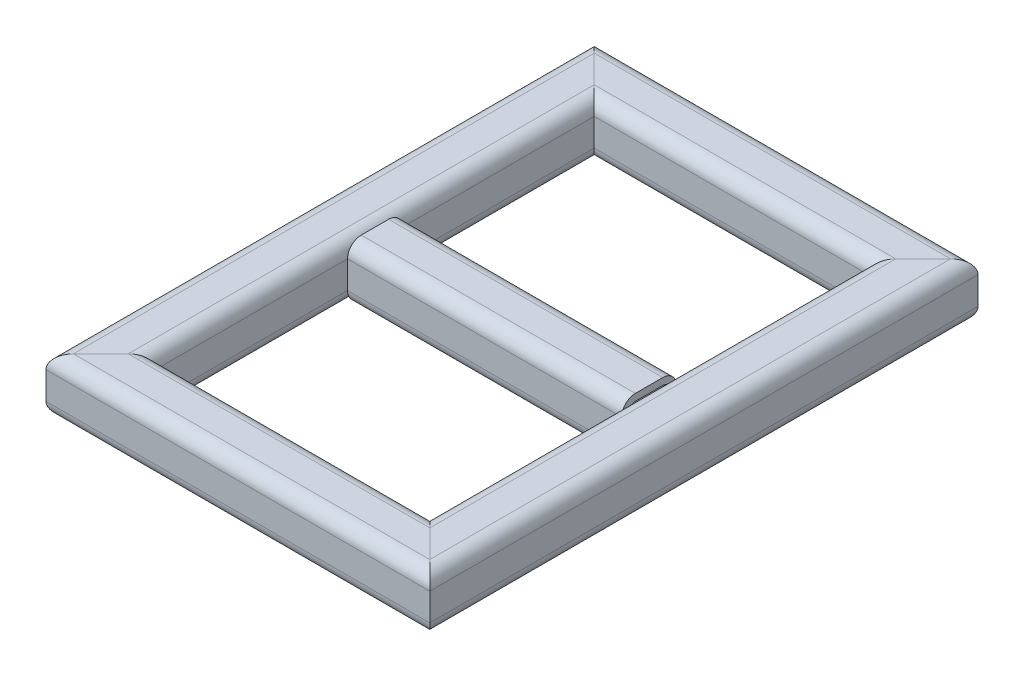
ISO-10303-21;
HEADER;
FILE_DESCRIPTION(('STEP AP214'),'2;1');
FILE_NAME('part.step','',(''),(''),'','','');
FILE_SCHEMA(('AUTOMOTIVE_DESIGN { 1 0 10303 214 1 1 1 1 }'));
ENDSEC;
DATA;
#1=APPLICATION_CONTEXT('core data for automotive mechanical design processes');
#2=APPLICATION_PROTOCOL_DEFINITION('international standard','automotive_design',2000,#1);
#3=PRODUCT_CONTEXT('',#1,'mechanical');
#4=PRODUCT('Part','Part','',(#3));
#5=PRODUCT_RELATED_PRODUCT_CATEGORY('part','',(#4));
#6=PRODUCT_DEFINITION_FORMATION('','',#4);
#7=PRODUCT_DEFINITION_CONTEXT('part definition',#1,'design');
#8=PRODUCT_DEFINITION('design','',#6,#7);
#9=PRODUCT_DEFINITION_SHAPE('','',#8);
#10=(LENGTH_UNIT() NAMED_UNIT(*) SI_UNIT(.MILLI.,.METRE.));
#11=(NAMED_UNIT(*) PLANE_ANGLE_UNIT() SI_UNIT($,.RADIAN.));
#12=(NAMED_UNIT(*) SI_UNIT($,.STERADIAN.) SOLID_ANGLE_UNIT());
#13=UNCERTAINTY_MEASURE_WITH_UNIT(LENGTH_MEASURE(1.E-05),#10,'distance_accuracy_value','');
#14=(GEOMETRIC_REPRESENTATION_CONTEXT(3) GLOBAL_UNCERTAINTY_ASSIGNED_CONTEXT((#13)) GLOBAL_UNIT_ASSIGNED_CONTEXT((#10,
#11,#12)) REPRESENTATION_CONTEXT('',''));
#15=CARTESIAN_POINT('',(0.,0.,0.));
#16=DIRECTION('',(0.,0.,1.));
#17=DIRECTION('',(1.,0.,0.));
#18=AXIS2_PLACEMENT_3D('',#15,#16,#17);
#19=CARTESIAN_POINT('',(304.8,-12.7,476.25));
#20=DIRECTION('',(0.,0.,-1.));
#21=DIRECTION('',(-1.,0.,0.));
#22=AXIS2_PLACEMENT_3D('',#19,#20,#21);
#23=PLANE('',#22);
#24=DIRECTION('',(0.,-1.,0.));
#25=VECTOR('',#24,1.);
#26=CARTESIAN_POINT('',(-19.05,-12.7,476.25));
#27=LINE('',#26,#25);
#28=CARTESIAN_POINT('',(-19.0499999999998,12.7,476.25));
#29=VERTEX_POINT('',#28);
#30=CARTESIAN_POINT('',(-19.05,-12.7,476.25));
#31=VERTEX_POINT('',#30);
#32=EDGE_CURVE('E12',#29,#31,#27,.T.);
#33=ORIENTED_EDGE('',*,*,#32,.F.);
#34=DIRECTION('',(-1.,0.,0.));
#35=VECTOR('',#34,1.);
#36=CARTESIAN_POINT('',(304.8,12.7,476.25));
#37=LINE('',#36,#35);
#38=CARTESIAN_POINT('',(323.85,12.7,476.25));
#39=VERTEX_POINT('',#38);
#40=EDGE_CURVE('E186',#39,#29,#37,.T.);
#41=ORIENTED_EDGE('',*,*,#40,.F.);
#42=DIRECTION('',(0.,-1.,0.));
#43=VECTOR('',#42,1.);
#44=CARTESIAN_POINT('',(323.85,-12.7,476.25));
#45=LINE('',#44,#43);
#46=CARTESIAN_POINT('',(323.85,-12.7,476.25));
#47=VERTEX_POINT('',#46);
#48=EDGE_CURVE('E166',#39,#47,#45,.T.);
#49=ORIENTED_EDGE('',*,*,#48,.T.);
#50=DIRECTION('',(-1.,0.,0.));
#51=VECTOR('',#50,1.);
#52=CARTESIAN_POINT('',(304.8,-12.7,476.25));
#53=LINE('',#52,#51);
#54=EDGE_CURVE('E178',#47,#31,#53,.T.);
#55=ORIENTED_EDGE('',*,*,#54,.T.);
#56=EDGE_LOOP('',(#33,#41,#49,#55));
#57=FACE_BOUND('',#56,.T.);
#58=ADVANCED_FACE('F44',(#57),#23,.T.);
#59=CARTESIAN_POINT('',(304.8,-12.7,469.9));
#60=DIRECTION('',(-1.,0.,0.));
#61=DIRECTION('',(0.,0.,1.));
#62=AXIS2_PLACEMENT_3D('',#59,#60,#61);
#63=CYLINDRICAL_SURFACE('',#62,6.35000000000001);
#64=CARTESIAN_POINT('',(-12.6999999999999,-12.7,469.9));
#65=DIRECTION('',(0.707106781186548,0.,0.707106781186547));
#66=DIRECTION('',(-0.707106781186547,0.,0.707106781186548));
#67=AXIS2_PLACEMENT_3D('',#64,#65,#66);
#68=ELLIPSE('',#67,8.98025612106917,6.35000000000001);
#69=CARTESIAN_POINT('',(-12.6999999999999,-19.05,469.9));
#70=VERTEX_POINT('',#69);
#71=EDGE_CURVE('E180',#31,#70,#68,.T.);
#72=ORIENTED_EDGE('',*,*,#71,.F.);
#73=ORIENTED_EDGE('',*,*,#54,.F.);
#74=CARTESIAN_POINT('',(317.5,-12.7,469.9));
#75=DIRECTION('',(0.707106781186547,0.,-0.707106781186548));
#76=DIRECTION('',(-0.707106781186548,0.,-0.707106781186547));
#77=AXIS2_PLACEMENT_3D('',#74,#75,#76);
#78=ELLIPSE('',#77,8.98025612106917,6.35000000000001);
#79=CARTESIAN_POINT('',(317.5,-19.05,469.9));
#80=VERTEX_POINT('',#79);
#81=EDGE_CURVE('E162',#47,#80,#78,.T.);
#82=ORIENTED_EDGE('',*,*,#81,.T.);
#83=DIRECTION('',(-1.,0.,0.));
#84=VECTOR('',#83,1.);
#85=CARTESIAN_POINT('',(304.8,-19.05,469.9));
#86=LINE('',#85,#84);
#87=EDGE_CURVE('E173',#80,#70,#86,.T.);
#88=ORIENTED_EDGE('',*,*,#87,.T.);
#89=EDGE_LOOP('',(#72,#73,#82,#88));
#90=FACE_BOUND('',#89,.T.);
#91=ADVANCED_FACE('F179',(#90),#63,.F.);
#92=CARTESIAN_POINT('',(304.8,-19.05,469.9));
#93=DIRECTION('',(0.,1.,0.));
#94=DIRECTION('',(0.,0.,1.));
#95=AXIS2_PLACEMENT_3D('',#92,#93,#94);
#96=PLANE('',#95);
#97=DIRECTION('',(0.707106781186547,0.,-0.707106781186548));
#98=VECTOR('',#97,1.);
#99=CARTESIAN_POINT('',(146.05,-19.05,311.15));
#100=LINE('',#99,#98);
#101=CARTESIAN_POINT('',(12.7,-19.05,444.5));
#102=VERTEX_POINT('',#101);
#103=EDGE_CURVE('E272',#70,#102,#100,.T.);
#104=ORIENTED_EDGE('',*,*,#103,.F.);
#105=ORIENTED_EDGE('',*,*,#87,.F.);
#106=DIRECTION('',(-0.707106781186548,0.,-0.707106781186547));
#107=VECTOR('',#106,1.);
#108=CARTESIAN_POINT('',(311.15,-19.05,463.55));
#109=LINE('',#108,#107);
#110=CARTESIAN_POINT('',(292.1,-19.05,444.5));
#111=VERTEX_POINT('',#110);
#112=EDGE_CURVE('E169',#80,#111,#109,.T.);
#113=ORIENTED_EDGE('',*,*,#112,.T.);
#114=DIRECTION('',(-1.,0.,0.));
#115=VECTOR('',#114,1.);
#116=CARTESIAN_POINT('',(304.8,-19.05,444.5));
#117=LINE('',#116,#115);
#118=EDGE_CURVE('E174',#111,#102,#117,.T.);
#119=ORIENTED_EDGE('',*,*,#118,.T.);
#120=EDGE_LOOP('',(#104,#105,#113,#119));
#121=FACE_BOUND('',#120,.T.);
#122=ADVANCED_FACE('F276',(#121),#96,.T.);
#123=CARTESIAN_POINT('',(304.8,-12.7,444.5));
#124=DIRECTION('',(-1.,0.,0.));
#125=DIRECTION('',(0.,0.,1.));
#126=AXIS2_PLACEMENT_3D('',#123,#124,#125);
#127=CYLINDRICAL_SURFACE('',#126,6.35000000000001);
#128=CARTESIAN_POINT('',(12.7,-12.7,444.5));
#129=DIRECTION('',(0.707106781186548,0.,0.707106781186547));
#130=DIRECTION('',(-0.707106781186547,0.,0.707106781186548));
#131=AXIS2_PLACEMENT_3D('',#128,#129,#130);
#132=ELLIPSE('',#131,8.98025612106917,6.35000000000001);
#133=CARTESIAN_POINT('',(19.0500000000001,-12.7,438.15));
#134=VERTEX_POINT('',#133);
#135=EDGE_CURVE('E278',#102,#134,#132,.T.);
#136=ORIENTED_EDGE('',*,*,#135,.F.);
#137=ORIENTED_EDGE('',*,*,#118,.F.);
#138=CARTESIAN_POINT('',(292.1,-12.7,444.5));
#139=DIRECTION('',(0.707106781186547,0.,-0.707106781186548));
#140=DIRECTION('',(-0.707106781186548,0.,-0.707106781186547));
#141=AXIS2_PLACEMENT_3D('',#138,#139,#140);
#142=ELLIPSE('',#141,8.98025612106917,6.35000000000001);
#143=CARTESIAN_POINT('',(285.75,-12.7,438.15));
#144=VERTEX_POINT('',#143);
#145=EDGE_CURVE('E229',#111,#144,#142,.T.);
#146=ORIENTED_EDGE('',*,*,#145,.T.);
#147=DIRECTION('',(-1.,0.,0.));
#148=VECTOR('',#147,1.);
#149=CARTESIAN_POINT('',(304.8,-12.7,438.15));
#150=LINE('',#149,#148);
#151=EDGE_CURVE('E232',#144,#134,#150,.T.);
#152=ORIENTED_EDGE('',*,*,#151,.T.);
#153=EDGE_LOOP('',(#136,#137,#146,#152));
#154=FACE_BOUND('',#153,.T.);
#155=ADVANCED_FACE('F342',(#154),#127,.F.);
#156=CARTESIAN_POINT('',(304.8,12.7,438.15));
#157=DIRECTION('',(0.,0.,1.));
#158=DIRECTION('',(1.,0.,0.));
#159=AXIS2_PLACEMENT_3D('',#156,#157,#158);
#160=PLANE('',#159);
#161=DIRECTION('',(0.,1.,0.));
#162=VECTOR('',#161,1.);
#163=CARTESIAN_POINT('',(19.0500000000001,12.7,438.15));
#164=LINE('',#163,#162);
#165=CARTESIAN_POINT('',(19.0500000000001,12.7,438.15));
#166=VERTEX_POINT('',#165);
#167=EDGE_CURVE('E99',#134,#166,#164,.T.);
#168=ORIENTED_EDGE('',*,*,#167,.F.);
#169=ORIENTED_EDGE('',*,*,#151,.F.);
#170=DIRECTION('',(0.,1.,0.));
#171=VECTOR('',#170,1.);
#172=CARTESIAN_POINT('',(285.75,12.7,438.15));
#173=LINE('',#172,#171);
#174=CARTESIAN_POINT('',(285.75,12.7,438.15));
#175=VERTEX_POINT('',#174);
#176=EDGE_CURVE('E225',#144,#175,#173,.T.);
#177=ORIENTED_EDGE('',*,*,#176,.T.);
#178=DIRECTION('',(-1.,0.,0.));
#179=VECTOR('',#178,1.);
#180=CARTESIAN_POINT('',(304.8,12.7,438.15));
#181=LINE('',#180,#179);
#182=EDGE_CURVE('E228',#175,#166,#181,.T.);
#183=ORIENTED_EDGE('',*,*,#182,.T.);
#184=EDGE_LOOP('',(#168,#169,#177,#183));
#185=FACE_BOUND('',#184,.T.);
#186=ADVANCED_FACE('F345',(#185),#160,.T.);
#187=CARTESIAN_POINT('',(304.8,12.7,444.5));
#188=DIRECTION('',(-1.,0.,0.));
#189=DIRECTION('',(0.,0.,1.));
#190=AXIS2_PLACEMENT_3D('',#187,#188,#189);
#191=CYLINDRICAL_SURFACE('',#190,6.35000000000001);
#192=CARTESIAN_POINT('',(12.7,12.7,444.5));
#193=DIRECTION('',(0.707106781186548,0.,0.707106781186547));
#194=DIRECTION('',(-0.707106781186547,0.,0.707106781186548));
#195=AXIS2_PLACEMENT_3D('',#192,#193,#194);
#196=ELLIPSE('',#195,8.98025612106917,6.35000000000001);
#197=CARTESIAN_POINT('',(12.7,19.05,444.5));
#198=VERTEX_POINT('',#197);
#199=EDGE_CURVE('E102',#166,#198,#196,.T.);
#200=ORIENTED_EDGE('',*,*,#199,.F.);
#201=ORIENTED_EDGE('',*,*,#182,.F.);
#202=CARTESIAN_POINT('',(292.1,12.7,444.5));
#203=DIRECTION('',(0.707106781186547,0.,-0.707106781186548));
#204=DIRECTION('',(-0.707106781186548,0.,-0.707106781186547));
#205=AXIS2_PLACEMENT_3D('',#202,#203,#204);
#206=ELLIPSE('',#205,8.98025612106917,6.35000000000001);
#207=CARTESIAN_POINT('',(292.1,19.05,444.5));
#208=VERTEX_POINT('',#207);
#209=EDGE_CURVE('E221',#175,#208,#206,.T.);
#210=ORIENTED_EDGE('',*,*,#209,.T.);
#211=DIRECTION('',(-1.,0.,0.));
#212=VECTOR('',#211,1.);
#213=CARTESIAN_POINT('',(304.8,19.05,444.5));
#214=LINE('',#213,#212);
#215=EDGE_CURVE('E224',#208,#198,#214,.T.);
#216=ORIENTED_EDGE('',*,*,#215,.T.);
#217=EDGE_LOOP('',(#200,#201,#210,#216));
#218=FACE_BOUND('',#217,.T.);
#219=ADVANCED_FACE('F349',(#218),#191,.F.);
#220=CARTESIAN_POINT('',(304.8,19.05,444.5));
#221=DIRECTION('',(0.,-1.,0.));
#222=DIRECTION('',(0.,0.,-1.));
#223=AXIS2_PLACEMENT_3D('',#220,#221,#222);
#224=PLANE('',#223);
#225=DIRECTION('',(-0.707106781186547,0.,0.707106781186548));
#226=VECTOR('',#225,1.);
#227=CARTESIAN_POINT('',(158.75,19.05,298.45));
#228=LINE('',#227,#226);
#229=CARTESIAN_POINT('',(-12.6999999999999,19.05,469.9));
#230=VERTEX_POINT('',#229);
#231=EDGE_CURVE('E106',#198,#230,#228,.T.);
#232=ORIENTED_EDGE('',*,*,#231,.F.);
#233=ORIENTED_EDGE('',*,*,#215,.F.);
#234=DIRECTION('',(0.707106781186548,0.,0.707106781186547));
#235=VECTOR('',#234,1.);
#236=CARTESIAN_POINT('',(298.45,19.05,450.85));
#237=LINE('',#236,#235);
#238=CARTESIAN_POINT('',(317.5,19.05,469.9));
#239=VERTEX_POINT('',#238);
#240=EDGE_CURVE('E217',#208,#239,#237,.T.);
#241=ORIENTED_EDGE('',*,*,#240,.T.);
#242=DIRECTION('',(-1.,0.,0.));
#243=VECTOR('',#242,1.);
#244=CARTESIAN_POINT('',(304.8,19.05,469.9));
#245=LINE('',#244,#243);
#246=EDGE_CURVE('E220',#239,#230,#245,.T.);
#247=ORIENTED_EDGE('',*,*,#246,.T.);
#248=EDGE_LOOP('',(#232,#233,#241,#247));
#249=FACE_BOUND('',#248,.T.);
#250=ADVANCED_FACE('F353',(#249),#224,.T.);
#251=CARTESIAN_POINT('',(304.8,12.7,469.9));
#252=DIRECTION('',(-1.,0.,0.));
#253=DIRECTION('',(0.,0.,1.));
#254=AXIS2_PLACEMENT_3D('',#251,#252,#253);
#255=CYLINDRICAL_SURFACE('',#254,6.35000000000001);
#256=CARTESIAN_POINT('',(-12.6999999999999,12.7,469.9));
#257=DIRECTION('',(0.707106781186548,0.,0.707106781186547));
#258=DIRECTION('',(-0.707106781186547,0.,0.707106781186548));
#259=AXIS2_PLACEMENT_3D('',#256,#257,#258);
#260=ELLIPSE('',#259,8.98025612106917,6.35000000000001);
#261=EDGE_CURVE('E109',#230,#29,#260,.T.);
#262=ORIENTED_EDGE('',*,*,#261,.F.);
#263=ORIENTED_EDGE('',*,*,#246,.F.);
#264=CARTESIAN_POINT('',(317.5,12.7,469.9));
#265=DIRECTION('',(0.707106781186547,0.,-0.707106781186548));
#266=DIRECTION('',(-0.707106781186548,0.,-0.707106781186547));
#267=AXIS2_PLACEMENT_3D('',#264,#265,#266);
#268=ELLIPSE('',#267,8.98025612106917,6.35000000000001);
#269=EDGE_CURVE('E214',#239,#39,#268,.T.);
#270=ORIENTED_EDGE('',*,*,#269,.T.);
#271=ORIENTED_EDGE('',*,*,#40,.T.);
#272=EDGE_LOOP('',(#262,#263,#270,#271));
#273=FACE_BOUND('',#272,.T.);
#274=ADVANCED_FACE('F268',(#273),#255,.F.);
#275=CARTESIAN_POINT('',(304.8,0.,457.2));
#276=DIRECTION('',(0.707106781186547,0.,-0.707106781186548));
#277=DIRECTION('',(-0.707106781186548,0.,-0.707106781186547));
#278=AXIS2_PLACEMENT_3D('',#275,#276,#277);
#279=PLANE('',#278);
#280=ORIENTED_EDGE('',*,*,#269,.F.);
#281=ORIENTED_EDGE('',*,*,#240,.F.);
#282=ORIENTED_EDGE('',*,*,#209,.F.);
#283=ORIENTED_EDGE('',*,*,#176,.F.);
#284=ORIENTED_EDGE('',*,*,#145,.F.);
#285=ORIENTED_EDGE('',*,*,#112,.F.);
#286=ORIENTED_EDGE('',*,*,#81,.F.);
#287=ORIENTED_EDGE('',*,*,#48,.F.);
#288=EDGE_LOOP('',(#280,#281,#282,#283,#284,#285,#286,#287));
#289=FACE_BOUND('',#288,.T.);
#290=DIRECTION('',(0.,1.,0.));
#291=VECTOR('',#290,1.);
#292=CARTESIAN_POINT('',(279.4,12.7,431.8));
#293=LINE('',#292,#291);
#294=CARTESIAN_POINT('',(279.4,-12.7,431.8));
#295=VERTEX_POINT('',#294);
#296=CARTESIAN_POINT('',(279.4,12.7,431.8));
#297=VERTEX_POINT('',#296);
#298=EDGE_CURVE('E213',#295,#297,#293,.T.);
#299=ORIENTED_EDGE('',*,*,#298,.T.);
#300=CARTESIAN_POINT('',(292.1,12.7,444.5));
#301=DIRECTION('',(0.707106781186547,0.,-0.707106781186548));
#302=DIRECTION('',(-0.707106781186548,0.,-0.707106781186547));
#303=AXIS2_PLACEMENT_3D('',#300,#301,#302);
#304=ELLIPSE('',#303,17.9605122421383,12.7);
#305=CARTESIAN_POINT('',(292.1,25.4,444.5));
#306=VERTEX_POINT('',#305);
#307=EDGE_CURVE('E210',#297,#306,#304,.T.);
#308=ORIENTED_EDGE('',*,*,#307,.T.);
#309=DIRECTION('',(0.707106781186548,0.,0.707106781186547));
#310=VECTOR('',#309,1.);
#311=CARTESIAN_POINT('',(298.45,25.4,450.85));
#312=LINE('',#311,#310);
#313=CARTESIAN_POINT('',(317.5,25.4,469.9));
#314=VERTEX_POINT('',#313);
#315=EDGE_CURVE('E207',#306,#314,#312,.T.);
#316=ORIENTED_EDGE('',*,*,#315,.T.);
#317=CARTESIAN_POINT('',(317.5,12.7,469.9));
#318=DIRECTION('',(0.707106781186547,0.,-0.707106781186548));
#319=DIRECTION('',(-0.707106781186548,0.,-0.707106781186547));
#320=AXIS2_PLACEMENT_3D('',#317,#318,#319);
#321=ELLIPSE('',#320,17.9605122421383,12.7);
#322=CARTESIAN_POINT('',(330.2,12.7,482.6));
#323=VERTEX_POINT('',#322);
#324=EDGE_CURVE('E204',#314,#323,#321,.T.);
#325=ORIENTED_EDGE('',*,*,#324,.T.);
#326=DIRECTION('',(0.,-1.,0.));
#327=VECTOR('',#326,1.);
#328=CARTESIAN_POINT('',(330.2,-12.7,482.6));
#329=LINE('',#328,#327);
#330=CARTESIAN_POINT('',(330.2,-12.7,482.6));
#331=VERTEX_POINT('',#330);
#332=EDGE_CURVE('E201',#323,#331,#329,.T.);
#333=ORIENTED_EDGE('',*,*,#332,.T.);
#334=CARTESIAN_POINT('',(317.5,-12.7,469.9));
#335=DIRECTION('',(0.707106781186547,0.,-0.707106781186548));
#336=DIRECTION('',(-0.707106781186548,0.,-0.707106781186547));
#337=AXIS2_PLACEMENT_3D('',#334,#335,#336);
#338=ELLIPSE('',#337,17.9605122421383,12.7);
#339=CARTESIAN_POINT('',(317.5,-25.4,469.9));
#340=VERTEX_POINT('',#339);
#341=EDGE_CURVE('E198',#331,#340,#338,.T.);
#342=ORIENTED_EDGE('',*,*,#341,.T.);
#343=DIRECTION('',(-0.707106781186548,0.,-0.707106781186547));
#344=VECTOR('',#343,1.);
#345=CARTESIAN_POINT('',(311.15,-25.4,463.55));
#346=LINE('',#345,#344);
#347=CARTESIAN_POINT('',(292.1,-25.4,444.5));
#348=VERTEX_POINT('',#347);
#349=EDGE_CURVE('E195',#340,#348,#346,.T.);
#350=ORIENTED_EDGE('',*,*,#349,.T.);
#351=CARTESIAN_POINT('',(292.1,-12.7,444.5));
#352=DIRECTION('',(0.707106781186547,0.,-0.707106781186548));
#353=DIRECTION('',(-0.707106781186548,0.,-0.707106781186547));
#354=AXIS2_PLACEMENT_3D('',#351,#352,#353);
#355=ELLIPSE('',#354,17.9605122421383,12.7);
#356=EDGE_CURVE('E192',#348,#295,#355,.T.);
#357=ORIENTED_EDGE('',*,*,#356,.T.);
#358=EDGE_LOOP('',(#299,#308,#316,#325,#333,#342,#350,#357));
#359=FACE_BOUND('',#358,.T.);
#360=ADVANCED_FACE('F46',(#289,#359),#279,.T.);
#361=CARTESIAN_POINT('',(304.8,12.7,431.8));
#362=DIRECTION('',(0.,0.,1.));
#363=DIRECTION('',(1.,0.,0.));
#364=AXIS2_PLACEMENT_3D('',#361,#362,#363);
#365=PLANE('',#364);
#366=DIRECTION('',(-1.,0.,0.));
#367=VECTOR('',#366,1.);
#368=CARTESIAN_POINT('',(304.8,-12.7,431.8));
#369=LINE('',#368,#367);
#370=CARTESIAN_POINT('',(25.4,-12.7,431.8));
#371=VERTEX_POINT('',#370);
#372=EDGE_CURVE('E183',#295,#371,#369,.T.);
#373=ORIENTED_EDGE('',*,*,#372,.T.);
#374=DIRECTION('',(0.,1.,0.));
#375=VECTOR('',#374,1.);
#376=CARTESIAN_POINT('',(25.4,12.7,431.8));
#377=LINE('',#376,#375);
#378=CARTESIAN_POINT('',(25.4000000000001,12.7,431.8));
#379=VERTEX_POINT('',#378);
#380=EDGE_CURVE('E48',#371,#379,#377,.T.);
#381=ORIENTED_EDGE('',*,*,#380,.T.);
#382=DIRECTION('',(-1.,0.,0.));
#383=VECTOR('',#382,1.);
#384=CARTESIAN_POINT('',(304.8,12.7,431.8));
#385=LINE('',#384,#383);
#386=EDGE_CURVE('E240',#297,#379,#385,.T.);
#387=ORIENTED_EDGE('',*,*,#386,.F.);
#388=ORIENTED_EDGE('',*,*,#298,.F.);
#389=EDGE_LOOP('',(#373,#381,#387,#388));
#390=FACE_BOUND('',#389,.T.);
#391=ADVANCED_FACE('F309',(#390),#365,.F.);
#392=CARTESIAN_POINT('',(304.8,-12.7,444.5));
#393=DIRECTION('',(-1.,0.,0.));
#394=DIRECTION('',(0.,0.,1.));
#395=AXIS2_PLACEMENT_3D('',#392,#393,#394);
#396=CYLINDRICAL_SURFACE('',#395,12.7);
#397=DIRECTION('',(-1.,0.,0.));
#398=VECTOR('',#397,1.);
#399=CARTESIAN_POINT('',(304.8,-25.4,444.5));
#400=LINE('',#399,#398);
#401=CARTESIAN_POINT('',(12.7,-25.4,444.5));
#402=VERTEX_POINT('',#401);
#403=EDGE_CURVE('E216',#348,#402,#400,.T.);
#404=ORIENTED_EDGE('',*,*,#403,.T.);
#405=CARTESIAN_POINT('',(12.7,-12.7,444.5));
#406=DIRECTION('',(0.707106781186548,0.,0.707106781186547));
#407=DIRECTION('',(-0.707106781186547,0.,0.707106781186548));
#408=AXIS2_PLACEMENT_3D('',#405,#406,#407);
#409=ELLIPSE('',#408,17.9605122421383,12.7);
#410=EDGE_CURVE('E54',#402,#371,#409,.T.);
#411=ORIENTED_EDGE('',*,*,#410,.T.);
#412=ORIENTED_EDGE('',*,*,#372,.F.);
#413=ORIENTED_EDGE('',*,*,#356,.F.);
#414=EDGE_LOOP('',(#404,#411,#412,#413));
#415=FACE_BOUND('',#414,.T.);
#416=ADVANCED_FACE('F305',(#415),#396,.T.);
#417=CARTESIAN_POINT('',(304.8,-25.4,469.9));
#418=DIRECTION('',(0.,1.,0.));
#419=DIRECTION('',(0.,0.,1.));
#420=AXIS2_PLACEMENT_3D('',#417,#418,#419);
#421=PLANE('',#420);
#422=DIRECTION('',(-1.,0.,0.));
#423=VECTOR('',#422,1.);
#424=CARTESIAN_POINT('',(304.8,-25.4,469.9));
#425=LINE('',#424,#423);
#426=CARTESIAN_POINT('',(-12.7,-25.4,469.9));
#427=VERTEX_POINT('',#426);
#428=EDGE_CURVE('E249',#340,#427,#425,.T.);
#429=ORIENTED_EDGE('',*,*,#428,.T.);
#430=DIRECTION('',(0.707106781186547,0.,-0.707106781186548));
#431=VECTOR('',#430,1.);
#432=CARTESIAN_POINT('',(146.05,-25.4,311.15));
#433=LINE('',#432,#431);
#434=EDGE_CURVE('E301',#427,#402,#433,.T.);
#435=ORIENTED_EDGE('',*,*,#434,.T.);
#436=ORIENTED_EDGE('',*,*,#403,.F.);
#437=ORIENTED_EDGE('',*,*,#349,.F.);
#438=EDGE_LOOP('',(#429,#435,#436,#437));
#439=FACE_BOUND('',#438,.T.);
#440=ADVANCED_FACE('F312',(#439),#421,.F.);
#441=CARTESIAN_POINT('',(304.8,-12.7,469.9));
#442=DIRECTION('',(-1.,0.,0.));
#443=DIRECTION('',(0.,0.,1.));
#444=AXIS2_PLACEMENT_3D('',#441,#442,#443);
#445=CYLINDRICAL_SURFACE('',#444,12.7);
#446=DIRECTION('',(-1.,0.,0.));
#447=VECTOR('',#446,1.);
#448=CARTESIAN_POINT('',(304.8,-12.7,482.6));
#449=LINE('',#448,#447);
#450=CARTESIAN_POINT('',(-25.3999999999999,-12.7,482.6));
#451=VERTEX_POINT('',#450);
#452=EDGE_CURVE('E246',#331,#451,#449,.T.);
#453=ORIENTED_EDGE('',*,*,#452,.T.);
#454=CARTESIAN_POINT('',(-12.6999999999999,-12.7,469.9));
#455=DIRECTION('',(0.707106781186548,0.,0.707106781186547));
#456=DIRECTION('',(-0.707106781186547,0.,0.707106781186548));
#457=AXIS2_PLACEMENT_3D('',#454,#455,#456);
#458=ELLIPSE('',#457,17.9605122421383,12.7);
#459=EDGE_CURVE('E298',#451,#427,#458,.T.);
#460=ORIENTED_EDGE('',*,*,#459,.T.);
#461=ORIENTED_EDGE('',*,*,#428,.F.);
#462=ORIENTED_EDGE('',*,*,#341,.F.);
#463=EDGE_LOOP('',(#453,#460,#461,#462));
#464=FACE_BOUND('',#463,.T.);
#465=ADVANCED_FACE('F316',(#464),#445,.T.);
#466=CARTESIAN_POINT('',(304.8,-12.7,482.6));
#467=DIRECTION('',(0.,0.,-1.));
#468=DIRECTION('',(-1.,0.,0.));
#469=AXIS2_PLACEMENT_3D('',#466,#467,#468);
#470=PLANE('',#469);
#471=DIRECTION('',(-1.,0.,0.));
#472=VECTOR('',#471,1.);
#473=CARTESIAN_POINT('',(304.8,12.7,482.6));
#474=LINE('',#473,#472);
#475=CARTESIAN_POINT('',(-25.3999999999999,12.7,482.6));
#476=VERTEX_POINT('',#475);
#477=EDGE_CURVE('E243',#323,#476,#474,.T.);
#478=ORIENTED_EDGE('',*,*,#477,.T.);
#479=DIRECTION('',(0.,-1.,0.));
#480=VECTOR('',#479,1.);
#481=CARTESIAN_POINT('',(-25.3999999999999,-12.7,482.6));
#482=LINE('',#481,#480);
#483=EDGE_CURVE('E295',#476,#451,#482,.T.);
#484=ORIENTED_EDGE('',*,*,#483,.T.);
#485=ORIENTED_EDGE('',*,*,#452,.F.);
#486=ORIENTED_EDGE('',*,*,#332,.F.);
#487=EDGE_LOOP('',(#478,#484,#485,#486));
#488=FACE_BOUND('',#487,.T.);
#489=ADVANCED_FACE('F318',(#488),#470,.F.);
#490=CARTESIAN_POINT('',(304.8,12.7,469.9));
#491=DIRECTION('',(-1.,0.,0.));
#492=DIRECTION('',(0.,0.,1.));
#493=AXIS2_PLACEMENT_3D('',#490,#491,#492);
#494=CYLINDRICAL_SURFACE('',#493,12.7);
#495=DIRECTION('',(-1.,0.,0.));
#496=VECTOR('',#495,1.);
#497=CARTESIAN_POINT('',(304.8,25.4,469.9));
#498=LINE('',#497,#496);
#499=CARTESIAN_POINT('',(-12.6999999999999,25.4,469.9));
#500=VERTEX_POINT('',#499);
#501=EDGE_CURVE('E239',#314,#500,#498,.T.);
#502=ORIENTED_EDGE('',*,*,#501,.T.);
#503=CARTESIAN_POINT('',(-12.6999999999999,12.7,469.9));
#504=DIRECTION('',(0.707106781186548,0.,0.707106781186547));
#505=DIRECTION('',(-0.707106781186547,0.,0.707106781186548));
#506=AXIS2_PLACEMENT_3D('',#503,#504,#505);
#507=ELLIPSE('',#506,17.9605122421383,12.7);
#508=EDGE_CURVE('E290',#500,#476,#507,.T.);
#509=ORIENTED_EDGE('',*,*,#508,.T.);
#510=ORIENTED_EDGE('',*,*,#477,.F.);
#511=ORIENTED_EDGE('',*,*,#324,.F.);
#512=EDGE_LOOP('',(#502,#509,#510,#511));
#513=FACE_BOUND('',#512,.T.);
#514=ADVANCED_FACE('F321',(#513),#494,.T.);
#515=CARTESIAN_POINT('',(304.8,25.4,444.5));
#516=DIRECTION('',(0.,-1.,0.));
#517=DIRECTION('',(0.,0.,-1.));
#518=AXIS2_PLACEMENT_3D('',#515,#516,#517);
#519=PLANE('',#518);
#520=DIRECTION('',(-1.,0.,0.));
#521=VECTOR('',#520,1.);
#522=CARTESIAN_POINT('',(304.8,25.4,444.5));
#523=LINE('',#522,#521);
#524=CARTESIAN_POINT('',(12.7,25.4,444.5));
#525=VERTEX_POINT('',#524);
#526=EDGE_CURVE('E236',#306,#525,#523,.T.);
#527=ORIENTED_EDGE('',*,*,#526,.T.);
#528=DIRECTION('',(-0.707106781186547,0.,0.707106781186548));
#529=VECTOR('',#528,1.);
#530=CARTESIAN_POINT('',(158.75,25.4,298.45));
#531=LINE('',#530,#529);
#532=EDGE_CURVE('E285',#525,#500,#531,.T.);
#533=ORIENTED_EDGE('',*,*,#532,.T.);
#534=ORIENTED_EDGE('',*,*,#501,.F.);
#535=ORIENTED_EDGE('',*,*,#315,.F.);
#536=EDGE_LOOP('',(#527,#533,#534,#535));
#537=FACE_BOUND('',#536,.T.);
#538=ADVANCED_FACE('F324',(#537),#519,.F.);
#539=CARTESIAN_POINT('',(304.8,12.7,444.5));
#540=DIRECTION('',(-1.,0.,0.));
#541=DIRECTION('',(0.,0.,1.));
#542=AXIS2_PLACEMENT_3D('',#539,#540,#541);
#543=CYLINDRICAL_SURFACE('',#542,12.7);
#544=ORIENTED_EDGE('',*,*,#386,.T.);
#545=CARTESIAN_POINT('',(12.7,12.7,444.5));
#546=DIRECTION('',(0.707106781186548,0.,0.707106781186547));
#547=DIRECTION('',(-0.707106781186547,0.,0.707106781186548));
#548=AXIS2_PLACEMENT_3D('',#545,#546,#547);
#549=ELLIPSE('',#548,17.9605122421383,12.7);
#550=EDGE_CURVE('E283',#379,#525,#549,.T.);
#551=ORIENTED_EDGE('',*,*,#550,.T.);
#552=ORIENTED_EDGE('',*,*,#526,.F.);
#553=ORIENTED_EDGE('',*,*,#307,.F.);
#554=EDGE_LOOP('',(#544,#551,#552,#553));
#555=FACE_BOUND('',#554,.T.);
#556=ADVANCED_FACE('F325',(#555),#543,.T.);
#557=CARTESIAN_POINT('',(0.,0.,457.2));
#558=DIRECTION('',(0.707106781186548,0.,0.707106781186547));
#559=DIRECTION('',(0.707106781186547,0.,-0.707106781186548));
#560=AXIS2_PLACEMENT_3D('',#557,#558,#559);
#561=PLANE('',#560);
#562=ORIENTED_EDGE('',*,*,#261,.T.);
#563=ORIENTED_EDGE('',*,*,#32,.T.);
#564=ORIENTED_EDGE('',*,*,#71,.T.);
#565=ORIENTED_EDGE('',*,*,#103,.T.);
#566=ORIENTED_EDGE('',*,*,#135,.T.);
#567=ORIENTED_EDGE('',*,*,#167,.T.);
#568=ORIENTED_EDGE('',*,*,#199,.T.);
#569=ORIENTED_EDGE('',*,*,#231,.T.);
#570=EDGE_LOOP('',(#562,#563,#564,#565,#566,#567,#568,#569));
#571=FACE_BOUND('',#570,.T.);
#572=ORIENTED_EDGE('',*,*,#380,.F.);
#573=ORIENTED_EDGE('',*,*,#410,.F.);
#574=ORIENTED_EDGE('',*,*,#434,.F.);
#575=ORIENTED_EDGE('',*,*,#459,.F.);
#576=ORIENTED_EDGE('',*,*,#483,.F.);
#577=ORIENTED_EDGE('',*,*,#508,.F.);
#578=ORIENTED_EDGE('',*,*,#532,.F.);
#579=ORIENTED_EDGE('',*,*,#550,.F.);
#580=EDGE_LOOP('',(#572,#573,#574,#575,#576,#577,#578,#579));
#581=FACE_BOUND('',#580,.T.);
#582=ADVANCED_FACE('F270',(#571,#581),#561,.F.);
#583=CLOSED_SHELL('',(#58,#91,#122,#155,#186,#219,#250,#274,#360,#391,#416,#440,#465,#489,#514,
#538,#556,#582));
#584=MANIFOLD_SOLID_BREP('B2',#583);
#585=CARTESIAN_POINT('',(323.85,-12.7,0.));
#586=DIRECTION('',(-1.,0.,0.));
#587=DIRECTION('',(0.,0.,1.));
#588=AXIS2_PLACEMENT_3D('',#585,#586,#587);
#589=PLANE('',#588);
#590=DIRECTION('',(0.,0.,1.));
#591=VECTOR('',#590,1.);
#592=CARTESIAN_POINT('',(323.85,12.7,0.));
#593=LINE('',#592,#591);
#594=CARTESIAN_POINT('',(323.85,12.7,-19.05));
#595=VERTEX_POINT('',#594);
#596=CARTESIAN_POINT('',(323.85,12.7,476.25));
#597=VERTEX_POINT('',#596);
#598=EDGE_CURVE('E496',#595,#597,#593,.T.);
#599=ORIENTED_EDGE('',*,*,#598,.F.);
#600=DIRECTION('',(0.,-1.,0.));
#601=VECTOR('',#600,1.);
#602=CARTESIAN_POINT('',(323.85,-12.7,-19.05));
#603=LINE('',#602,#601);
#604=CARTESIAN_POINT('',(323.85,-12.7,-19.05));
#605=VERTEX_POINT('',#604);
#606=EDGE_CURVE('E537',#595,#605,#603,.T.);
#607=ORIENTED_EDGE('',*,*,#606,.T.);
#608=DIRECTION('',(0.,0.,1.));
#609=VECTOR('',#608,1.);
#610=CARTESIAN_POINT('',(323.85,-12.7,0.));
#611=LINE('',#610,#609);
#612=CARTESIAN_POINT('',(323.85,-12.7,476.25));
#613=VERTEX_POINT('',#612);
#614=EDGE_CURVE('E627',#605,#613,#611,.T.);
#615=ORIENTED_EDGE('',*,*,#614,.T.);
#616=DIRECTION('',(0.,-1.,0.));
#617=VECTOR('',#616,1.);
#618=CARTESIAN_POINT('',(323.85,-12.7,476.25));
#619=LINE('',#618,#617);
#620=EDGE_CURVE('E620',#597,#613,#619,.T.);
#621=ORIENTED_EDGE('',*,*,#620,.F.);
#622=EDGE_LOOP('',(#599,#607,#615,#621));
#623=FACE_BOUND('',#622,.T.);
#624=ADVANCED_FACE('F492',(#623),#589,.T.);
#625=CARTESIAN_POINT('',(317.5,-12.7,0.));
#626=DIRECTION('',(0.,0.,1.));
#627=DIRECTION('',(1.,0.,0.));
#628=AXIS2_PLACEMENT_3D('',#625,#626,#627);
#629=CYLINDRICAL_SURFACE('',#628,6.35000000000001);
#630=ORIENTED_EDGE('',*,*,#614,.F.);
#631=CARTESIAN_POINT('',(317.5,-12.7,-12.7));
#632=DIRECTION('',(-0.707106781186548,0.,-0.707106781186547));
#633=DIRECTION('',(-0.707106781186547,0.,0.707106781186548));
#634=AXIS2_PLACEMENT_3D('',#631,#632,#633);
#635=ELLIPSE('',#634,8.98025612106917,6.35000000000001);
#636=CARTESIAN_POINT('',(317.5,-19.05,-12.7));
#637=VERTEX_POINT('',#636);
#638=EDGE_CURVE('E511',#605,#637,#635,.T.);
#639=ORIENTED_EDGE('',*,*,#638,.T.);
#640=DIRECTION('',(0.,0.,1.));
#641=VECTOR('',#640,1.);
#642=CARTESIAN_POINT('',(317.5,-19.05,0.));
#643=LINE('',#642,#641);
#644=CARTESIAN_POINT('',(317.5,-19.05,469.9));
#645=VERTEX_POINT('',#644);
#646=EDGE_CURVE('E683',#637,#645,#643,.T.);
#647=ORIENTED_EDGE('',*,*,#646,.T.);
#648=CARTESIAN_POINT('',(317.5,-12.7,469.9));
#649=DIRECTION('',(0.707106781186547,0.,-0.707106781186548));
#650=DIRECTION('',(0.707106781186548,0.,0.707106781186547));
#651=AXIS2_PLACEMENT_3D('',#648,#649,#650);
#652=ELLIPSE('',#651,8.98025612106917,6.35000000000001);
#653=EDGE_CURVE('E628',#613,#645,#652,.T.);
#654=ORIENTED_EDGE('',*,*,#653,.F.);
#655=EDGE_LOOP('',(#630,#639,#647,#654));
#656=FACE_BOUND('',#655,.T.);
#657=ADVANCED_FACE('F721',(#656),#629,.F.);
#658=CARTESIAN_POINT('',(317.5,-19.05,0.));
#659=DIRECTION('',(0.,1.,0.));
#660=DIRECTION('',(0.,0.,1.));
#661=AXIS2_PLACEMENT_3D('',#658,#659,#660);
#662=PLANE('',#661);
#663=ORIENTED_EDGE('',*,*,#646,.F.);
#664=DIRECTION('',(-0.707106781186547,0.,0.707106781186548));
#665=VECTOR('',#664,1.);
#666=CARTESIAN_POINT('',(311.15,-19.05,-6.34999999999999));
#667=LINE('',#666,#665);
#668=CARTESIAN_POINT('',(292.1,-19.05,12.7));
#669=VERTEX_POINT('',#668);
#670=EDGE_CURVE('E684',#637,#669,#667,.T.);
#671=ORIENTED_EDGE('',*,*,#670,.T.);
#672=DIRECTION('',(0.,0.,1.));
#673=VECTOR('',#672,1.);
#674=CARTESIAN_POINT('',(292.1,-19.05,0.));
#675=LINE('',#674,#673);
#676=CARTESIAN_POINT('',(292.1,-19.05,444.5));
#677=VERTEX_POINT('',#676);
#678=EDGE_CURVE('E687',#669,#677,#675,.T.);
#679=ORIENTED_EDGE('',*,*,#678,.T.);
#680=DIRECTION('',(-0.707106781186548,0.,-0.707106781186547));
#681=VECTOR('',#680,1.);
#682=CARTESIAN_POINT('',(82.55,-19.05,234.95));
#683=LINE('',#682,#681);
#684=EDGE_CURVE('E630',#645,#677,#683,.T.);
#685=ORIENTED_EDGE('',*,*,#684,.F.);
#686=EDGE_LOOP('',(#663,#671,#679,#685));
#687=FACE_BOUND('',#686,.T.);
#688=ADVANCED_FACE('F727',(#687),#662,.T.);
#689=CARTESIAN_POINT('',(292.1,-12.7,0.));
#690=DIRECTION('',(0.,0.,1.));
#691=DIRECTION('',(1.,0.,0.));
#692=AXIS2_PLACEMENT_3D('',#689,#690,#691);
#693=CYLINDRICAL_SURFACE('',#692,6.35000000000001);
#694=ORIENTED_EDGE('',*,*,#678,.F.);
#695=CARTESIAN_POINT('',(292.1,-12.7,12.7));
#696=DIRECTION('',(-0.707106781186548,0.,-0.707106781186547));
#697=DIRECTION('',(-0.707106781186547,0.,0.707106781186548));
#698=AXIS2_PLACEMENT_3D('',#695,#696,#697);
#699=ELLIPSE('',#698,8.98025612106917,6.35000000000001);
#700=CARTESIAN_POINT('',(285.75,-12.7,19.05));
#701=VERTEX_POINT('',#700);
#702=EDGE_CURVE('E688',#669,#701,#699,.T.);
#703=ORIENTED_EDGE('',*,*,#702,.T.);
#704=DIRECTION('',(0.,0.,1.));
#705=VECTOR('',#704,1.);
#706=CARTESIAN_POINT('',(285.75,-12.7,0.));
#707=LINE('',#706,#705);
#708=CARTESIAN_POINT('',(285.75,-12.7,438.15));
#709=VERTEX_POINT('',#708);
#710=EDGE_CURVE('E691',#701,#709,#707,.T.);
#711=ORIENTED_EDGE('',*,*,#710,.T.);
#712=CARTESIAN_POINT('',(292.1,-12.7,444.5));
#713=DIRECTION('',(0.707106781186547,0.,-0.707106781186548));
#714=DIRECTION('',(0.707106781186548,0.,0.707106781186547));
#715=AXIS2_PLACEMENT_3D('',#712,#713,#714);
#716=ELLIPSE('',#715,8.98025612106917,6.35000000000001);
#717=EDGE_CURVE('E729',#677,#709,#716,.T.);
#718=ORIENTED_EDGE('',*,*,#717,.F.);
#719=EDGE_LOOP('',(#694,#703,#711,#718));
#720=FACE_BOUND('',#719,.T.);
#721=ADVANCED_FACE('F789',(#720),#693,.F.);
#722=CARTESIAN_POINT('',(285.75,12.7,0.));
#723=DIRECTION('',(1.,0.,0.));
#724=DIRECTION('',(0.,0.,-1.));
#725=AXIS2_PLACEMENT_3D('',#722,#723,#724);
#726=PLANE('',#725);
#727=ORIENTED_EDGE('',*,*,#710,.F.);
#728=DIRECTION('',(0.,1.,0.));
#729=VECTOR('',#728,1.);
#730=CARTESIAN_POINT('',(285.75,12.7,19.05));
#731=LINE('',#730,#729);
#732=CARTESIAN_POINT('',(285.75,12.7,19.05));
#733=VERTEX_POINT('',#732);
#734=EDGE_CURVE('E692',#701,#733,#731,.T.);
#735=ORIENTED_EDGE('',*,*,#734,.T.);
#736=DIRECTION('',(0.,0.,1.));
#737=VECTOR('',#736,1.);
#738=CARTESIAN_POINT('',(285.75,12.7,0.));
#739=LINE('',#738,#737);
#740=CARTESIAN_POINT('',(285.75,12.7,438.15));
#741=VERTEX_POINT('',#740);
#742=EDGE_CURVE('E695',#733,#741,#739,.T.);
#743=ORIENTED_EDGE('',*,*,#742,.T.);
#744=DIRECTION('',(0.,1.,0.));
#745=VECTOR('',#744,1.);
#746=CARTESIAN_POINT('',(285.75,12.7,438.15));
#747=LINE('',#746,#745);
#748=EDGE_CURVE('E730',#709,#741,#747,.T.);
#749=ORIENTED_EDGE('',*,*,#748,.F.);
#750=EDGE_LOOP('',(#727,#735,#743,#749));
#751=FACE_BOUND('',#750,.T.);
#752=ADVANCED_FACE('F792',(#751),#726,.T.);
#753=CARTESIAN_POINT('',(292.1,12.7,0.));
#754=DIRECTION('',(0.,0.,1.));
#755=DIRECTION('',(1.,0.,0.));
#756=AXIS2_PLACEMENT_3D('',#753,#754,#755);
#757=CYLINDRICAL_SURFACE('',#756,6.35000000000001);
#758=ORIENTED_EDGE('',*,*,#742,.F.);
#759=CARTESIAN_POINT('',(292.1,12.7,12.7));
#760=DIRECTION('',(-0.707106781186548,0.,-0.707106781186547));
#761=DIRECTION('',(-0.707106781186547,0.,0.707106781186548));
#762=AXIS2_PLACEMENT_3D('',#759,#760,#761);
#763=ELLIPSE('',#762,8.98025612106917,6.35000000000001);
#764=CARTESIAN_POINT('',(292.1,19.05,12.7000000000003));
#765=VERTEX_POINT('',#764);
#766=EDGE_CURVE('E696',#733,#765,#763,.T.);
#767=ORIENTED_EDGE('',*,*,#766,.T.);
#768=DIRECTION('',(0.,0.,1.));
#769=VECTOR('',#768,1.);
#770=CARTESIAN_POINT('',(292.1,19.05,0.));
#771=LINE('',#770,#769);
#772=CARTESIAN_POINT('',(292.1,19.05,444.5));
#773=VERTEX_POINT('',#772);
#774=EDGE_CURVE('E699',#765,#773,#771,.T.);
#775=ORIENTED_EDGE('',*,*,#774,.T.);
#776=CARTESIAN_POINT('',(292.1,12.7,444.5));
#777=DIRECTION('',(0.707106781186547,0.,-0.707106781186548));
#778=DIRECTION('',(0.707106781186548,0.,0.707106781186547));
#779=AXIS2_PLACEMENT_3D('',#776,#777,#778);
#780=ELLIPSE('',#779,8.98025612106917,6.35000000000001);
#781=EDGE_CURVE('E735',#741,#773,#780,.T.);
#782=ORIENTED_EDGE('',*,*,#781,.F.);
#783=EDGE_LOOP('',(#758,#767,#775,#782));
#784=FACE_BOUND('',#783,.T.);
#785=ADVANCED_FACE('F796',(#784),#757,.F.);
#786=CARTESIAN_POINT('',(292.1,19.05,0.));
#787=DIRECTION('',(0.,-1.,0.));
#788=DIRECTION('',(0.,0.,-1.));
#789=AXIS2_PLACEMENT_3D('',#786,#787,#788);
#790=PLANE('',#789);
#791=ORIENTED_EDGE('',*,*,#774,.F.);
#792=DIRECTION('',(0.707106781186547,0.,-0.707106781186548));
#793=VECTOR('',#792,1.);
#794=CARTESIAN_POINT('',(298.45,19.05,6.34999999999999));
#795=LINE('',#794,#793);
#796=CARTESIAN_POINT('',(317.5,19.05,-12.7));
#797=VERTEX_POINT('',#796);
#798=EDGE_CURVE('E700',#765,#797,#795,.T.);
#799=ORIENTED_EDGE('',*,*,#798,.T.);
#800=DIRECTION('',(0.,0.,1.));
#801=VECTOR('',#800,1.);
#802=CARTESIAN_POINT('',(317.5,19.05,0.));
#803=LINE('',#802,#801);
#804=CARTESIAN_POINT('',(317.5,19.05,469.9));
#805=VERTEX_POINT('',#804);
#806=EDGE_CURVE('E662',#797,#805,#803,.T.);
#807=ORIENTED_EDGE('',*,*,#806,.T.);
#808=DIRECTION('',(0.707106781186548,0.,0.707106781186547));
#809=VECTOR('',#808,1.);
#810=CARTESIAN_POINT('',(69.8500000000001,19.05,222.25));
#811=LINE('',#810,#809);
#812=EDGE_CURVE('E624',#773,#805,#811,.T.);
#813=ORIENTED_EDGE('',*,*,#812,.F.);
#814=EDGE_LOOP('',(#791,#799,#807,#813));
#815=FACE_BOUND('',#814,.T.);
#816=ADVANCED_FACE('F800',(#815),#790,.T.);
#817=CARTESIAN_POINT('',(317.5,12.7,0.));
#818=DIRECTION('',(0.,0.,1.));
#819=DIRECTION('',(1.,0.,0.));
#820=AXIS2_PLACEMENT_3D('',#817,#818,#819);
#821=CYLINDRICAL_SURFACE('',#820,6.35000000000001);
#822=ORIENTED_EDGE('',*,*,#806,.F.);
#823=CARTESIAN_POINT('',(317.5,12.7,-12.7));
#824=DIRECTION('',(-0.707106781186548,0.,-0.707106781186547));
#825=DIRECTION('',(-0.707106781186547,0.,0.707106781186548));
#826=AXIS2_PLACEMENT_3D('',#823,#824,#825);
#827=ELLIPSE('',#826,8.98025612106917,6.35000000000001);
#828=EDGE_CURVE('E533',#797,#595,#827,.T.);
#829=ORIENTED_EDGE('',*,*,#828,.T.);
#830=ORIENTED_EDGE('',*,*,#598,.T.);
#831=CARTESIAN_POINT('',(317.5,12.7,469.9));
#832=DIRECTION('',(0.707106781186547,0.,-0.707106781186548));
#833=DIRECTION('',(0.707106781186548,0.,0.707106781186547));
#834=AXIS2_PLACEMENT_3D('',#831,#832,#833);
#835=ELLIPSE('',#834,8.98025612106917,6.35000000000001);
#836=EDGE_CURVE('E610',#805,#597,#835,.T.);
#837=ORIENTED_EDGE('',*,*,#836,.F.);
#838=EDGE_LOOP('',(#822,#829,#830,#837));
#839=FACE_BOUND('',#838,.T.);
#840=ADVANCED_FACE('F609',(#839),#821,.F.);
#841=CARTESIAN_POINT('',(279.4,12.7,0.));
#842=DIRECTION('',(1.,0.,0.));
#843=DIRECTION('',(0.,0.,-1.));
#844=AXIS2_PLACEMENT_3D('',#841,#842,#843);
#845=PLANE('',#844);
#846=DIRECTION('',(0.,1.,0.));
#847=VECTOR('',#846,1.);
#848=CARTESIAN_POINT('',(279.4,12.7,25.4));
#849=LINE('',#848,#847);
#850=CARTESIAN_POINT('',(279.4,-12.7,25.4));
#851=VERTEX_POINT('',#850);
#852=CARTESIAN_POINT('',(279.4,12.7,25.4));
#853=VERTEX_POINT('',#852);
#854=EDGE_CURVE('E663',#851,#853,#849,.T.);
#855=ORIENTED_EDGE('',*,*,#854,.F.);
#856=DIRECTION('',(0.,0.,1.));
#857=VECTOR('',#856,1.);
#858=CARTESIAN_POINT('',(279.4,-12.7,0.));
#859=LINE('',#858,#857);
#860=CARTESIAN_POINT('',(279.4,-12.7,431.8));
#861=VERTEX_POINT('',#860);
#862=EDGE_CURVE('E613',#851,#861,#859,.T.);
#863=ORIENTED_EDGE('',*,*,#862,.T.);
#864=DIRECTION('',(0.,1.,0.));
#865=VECTOR('',#864,1.);
#866=CARTESIAN_POINT('',(279.4,12.7,431.8));
#867=LINE('',#866,#865);
#868=CARTESIAN_POINT('',(279.4,12.7,431.8));
#869=VERTEX_POINT('',#868);
#870=EDGE_CURVE('E710',#861,#869,#867,.T.);
#871=ORIENTED_EDGE('',*,*,#870,.T.);
#872=DIRECTION('',(0.,0.,1.));
#873=VECTOR('',#872,1.);
#874=CARTESIAN_POINT('',(279.4,12.7,0.));
#875=LINE('',#874,#873);
#876=EDGE_CURVE('E636',#853,#869,#875,.T.);
#877=ORIENTED_EDGE('',*,*,#876,.F.);
#878=EDGE_LOOP('',(#855,#863,#871,#877));
#879=FACE_BOUND('',#878,.T.);
#880=ADVANCED_FACE('F741',(#879),#845,.F.);
#881=CARTESIAN_POINT('',(292.1,-12.7,0.));
#882=DIRECTION('',(0.,0.,1.));
#883=DIRECTION('',(1.,0.,0.));
#884=AXIS2_PLACEMENT_3D('',#881,#882,#883);
#885=CYLINDRICAL_SURFACE('',#884,12.7);
#886=CARTESIAN_POINT('',(292.1,-12.7,12.7));
#887=DIRECTION('',(-0.707106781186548,0.,-0.707106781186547));
#888=DIRECTION('',(-0.707106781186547,0.,0.707106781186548));
#889=AXIS2_PLACEMENT_3D('',#886,#887,#888);
#890=ELLIPSE('',#889,17.9605122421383,12.7);
#891=CARTESIAN_POINT('',(292.1,-25.4,12.7));
#892=VERTEX_POINT('',#891);
#893=EDGE_CURVE('E667',#892,#851,#890,.T.);
#894=ORIENTED_EDGE('',*,*,#893,.F.);
#895=DIRECTION('',(0.,0.,1.));
#896=VECTOR('',#895,1.);
#897=CARTESIAN_POINT('',(292.1,-25.4,0.));
#898=LINE('',#897,#896);
#899=CARTESIAN_POINT('',(292.1,-25.4,444.5));
#900=VERTEX_POINT('',#899);
#901=EDGE_CURVE('E660',#892,#900,#898,.T.);
#902=ORIENTED_EDGE('',*,*,#901,.T.);
#903=CARTESIAN_POINT('',(292.1,-12.7,444.5));
#904=DIRECTION('',(0.707106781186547,0.,-0.707106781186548));
#905=DIRECTION('',(0.707106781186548,0.,0.707106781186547));
#906=AXIS2_PLACEMENT_3D('',#903,#904,#905);
#907=ELLIPSE('',#906,17.9605122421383,12.7);
#908=EDGE_CURVE('E657',#900,#861,#907,.T.);
#909=ORIENTED_EDGE('',*,*,#908,.T.);
#910=ORIENTED_EDGE('',*,*,#862,.F.);
#911=EDGE_LOOP('',(#894,#902,#909,#910));
#912=FACE_BOUND('',#911,.T.);
#913=ADVANCED_FACE('F749',(#912),#885,.T.);
#914=CARTESIAN_POINT('',(317.5,-25.4,0.));
#915=DIRECTION('',(0.,1.,0.));
#916=DIRECTION('',(0.,0.,1.));
#917=AXIS2_PLACEMENT_3D('',#914,#915,#916);
#918=PLANE('',#917);
#919=DIRECTION('',(-0.707106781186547,0.,0.707106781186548));
#920=VECTOR('',#919,1.);
#921=CARTESIAN_POINT('',(311.15,-25.4,-6.34999999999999));
#922=LINE('',#921,#920);
#923=CARTESIAN_POINT('',(317.5,-25.4,-12.7));
#924=VERTEX_POINT('',#923);
#925=EDGE_CURVE('E42',#924,#892,#922,.T.);
#926=ORIENTED_EDGE('',*,*,#925,.F.);
#927=DIRECTION('',(0.,0.,1.));
#928=VECTOR('',#927,1.);
#929=CARTESIAN_POINT('',(317.5,-25.4,0.));
#930=LINE('',#929,#928);
#931=CARTESIAN_POINT('',(317.5,-25.4,469.9));
#932=VERTEX_POINT('',#931);
#933=EDGE_CURVE('E656',#924,#932,#930,.T.);
#934=ORIENTED_EDGE('',*,*,#933,.T.);
#935=DIRECTION('',(-0.707106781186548,0.,-0.707106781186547));
#936=VECTOR('',#935,1.);
#937=CARTESIAN_POINT('',(82.55,-25.4,234.95));
#938=LINE('',#937,#936);
#939=EDGE_CURVE('E653',#932,#900,#938,.T.);
#940=ORIENTED_EDGE('',*,*,#939,.T.);
#941=ORIENTED_EDGE('',*,*,#901,.F.);
#942=EDGE_LOOP('',(#926,#934,#940,#941));
#943=FACE_BOUND('',#942,.T.);
#944=ADVANCED_FACE('F752',(#943),#918,.F.);
#945=CARTESIAN_POINT('',(317.5,-12.7,0.));
#946=DIRECTION('',(0.,0.,1.));
#947=DIRECTION('',(1.,0.,0.));
#948=AXIS2_PLACEMENT_3D('',#945,#946,#947);
#949=CYLINDRICAL_SURFACE('',#948,12.7);
#950=CARTESIAN_POINT('',(317.5,-12.7,-12.7));
#951=DIRECTION('',(-0.707106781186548,0.,-0.707106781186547));
#952=DIRECTION('',(-0.707106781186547,0.,0.707106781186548));
#953=AXIS2_PLACEMENT_3D('',#950,#951,#952);
#954=ELLIPSE('',#953,17.9605122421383,12.7);
#955=CARTESIAN_POINT('',(330.2,-12.7,-25.4));
#956=VERTEX_POINT('',#955);
#957=EDGE_CURVE('E502',#956,#924,#954,.T.);
#958=ORIENTED_EDGE('',*,*,#957,.F.);
#959=DIRECTION('',(0.,0.,1.));
#960=VECTOR('',#959,1.);
#961=CARTESIAN_POINT('',(330.2,-12.7,0.));
#962=LINE('',#961,#960);
#963=CARTESIAN_POINT('',(330.2,-12.7,482.6));
#964=VERTEX_POINT('',#963);
#965=EDGE_CURVE('E652',#956,#964,#962,.T.);
#966=ORIENTED_EDGE('',*,*,#965,.T.);
#967=CARTESIAN_POINT('',(317.5,-12.7,469.9));
#968=DIRECTION('',(0.707106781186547,0.,-0.707106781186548));
#969=DIRECTION('',(0.707106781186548,0.,0.707106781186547));
#970=AXIS2_PLACEMENT_3D('',#967,#968,#969);
#971=ELLIPSE('',#970,17.9605122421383,12.7);
#972=EDGE_CURVE('E649',#964,#932,#971,.T.);
#973=ORIENTED_EDGE('',*,*,#972,.T.);
#974=ORIENTED_EDGE('',*,*,#933,.F.);
#975=EDGE_LOOP('',(#958,#966,#973,#974));
#976=FACE_BOUND('',#975,.T.);
#977=ADVANCED_FACE('F757',(#976),#949,.T.);
#978=CARTESIAN_POINT('',(330.2,-12.7,0.));
#979=DIRECTION('',(-1.,0.,0.));
#980=DIRECTION('',(0.,0.,1.));
#981=AXIS2_PLACEMENT_3D('',#978,#979,#980);
#982=PLANE('',#981);
#983=DIRECTION('',(0.,-1.,0.));
#984=VECTOR('',#983,1.);
#985=CARTESIAN_POINT('',(330.2,-12.7,-25.4));
#986=LINE('',#985,#984);
#987=CARTESIAN_POINT('',(330.2,12.7,-25.4));
#988=VERTEX_POINT('',#987);
#989=EDGE_CURVE('E672',#988,#956,#986,.T.);
#990=ORIENTED_EDGE('',*,*,#989,.F.);
#991=DIRECTION('',(0.,0.,1.));
#992=VECTOR('',#991,1.);
#993=CARTESIAN_POINT('',(330.2,12.7,0.));
#994=LINE('',#993,#992);
#995=CARTESIAN_POINT('',(330.2,12.7,482.6));
#996=VERTEX_POINT('',#995);
#997=EDGE_CURVE('E648',#988,#996,#994,.T.);
#998=ORIENTED_EDGE('',*,*,#997,.T.);
#999=DIRECTION('',(0.,-1.,0.));
#1000=VECTOR('',#999,1.);
#1001=CARTESIAN_POINT('',(330.2,-12.7,482.6));
#1002=LINE('',#1001,#1000);
#1003=EDGE_CURVE('E645',#996,#964,#1002,.T.);
#1004=ORIENTED_EDGE('',*,*,#1003,.T.);
#1005=ORIENTED_EDGE('',*,*,#965,.F.);
#1006=EDGE_LOOP('',(#990,#998,#1004,#1005));
#1007=FACE_BOUND('',#1006,.T.);
#1008=ADVANCED_FACE('F760',(#1007),#982,.F.);
#1009=CARTESIAN_POINT('',(317.5,12.7,0.));
#1010=DIRECTION('',(0.,0.,1.));
#1011=DIRECTION('',(1.,0.,0.));
#1012=AXIS2_PLACEMENT_3D('',#1009,#1010,#1011);
#1013=CYLINDRICAL_SURFACE('',#1012,12.7);
#1014=CARTESIAN_POINT('',(317.5,12.7,-12.7));
#1015=DIRECTION('',(-0.707106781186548,0.,-0.707106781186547));
#1016=DIRECTION('',(-0.707106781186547,0.,0.707106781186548));
#1017=AXIS2_PLACEMENT_3D('',#1014,#1015,#1016);
#1018=ELLIPSE('',#1017,17.9605122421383,12.7);
#1019=CARTESIAN_POINT('',(317.5,25.4,-12.7));
#1020=VERTEX_POINT('',#1019);
#1021=EDGE_CURVE('E675',#1020,#988,#1018,.T.);
#1022=ORIENTED_EDGE('',*,*,#1021,.F.);
#1023=DIRECTION('',(0.,0.,1.));
#1024=VECTOR('',#1023,1.);
#1025=CARTESIAN_POINT('',(317.5,25.4,0.));
#1026=LINE('',#1025,#1024);
#1027=CARTESIAN_POINT('',(317.5,25.4,469.9));
#1028=VERTEX_POINT('',#1027);
#1029=EDGE_CURVE('E644',#1020,#1028,#1026,.T.);
#1030=ORIENTED_EDGE('',*,*,#1029,.T.);
#1031=CARTESIAN_POINT('',(317.5,12.7,469.9));
#1032=DIRECTION('',(0.707106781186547,0.,-0.707106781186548));
#1033=DIRECTION('',(0.707106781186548,0.,0.707106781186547));
#1034=AXIS2_PLACEMENT_3D('',#1031,#1032,#1033);
#1035=ELLIPSE('',#1034,17.9605122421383,12.7);
#1036=EDGE_CURVE('E641',#1028,#996,#1035,.T.);
#1037=ORIENTED_EDGE('',*,*,#1036,.T.);
#1038=ORIENTED_EDGE('',*,*,#997,.F.);
#1039=EDGE_LOOP('',(#1022,#1030,#1037,#1038));
#1040=FACE_BOUND('',#1039,.T.);
#1041=ADVANCED_FACE('F765',(#1040),#1013,.T.);
#1042=CARTESIAN_POINT('',(292.1,25.4,0.));
#1043=DIRECTION('',(0.,-1.,0.));
#1044=DIRECTION('',(0.,0.,-1.));
#1045=AXIS2_PLACEMENT_3D('',#1042,#1043,#1044);
#1046=PLANE('',#1045);
#1047=DIRECTION('',(0.707106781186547,0.,-0.707106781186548));
#1048=VECTOR('',#1047,1.);
#1049=CARTESIAN_POINT('',(298.45,25.4,6.34999999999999));
#1050=LINE('',#1049,#1048);
#1051=CARTESIAN_POINT('',(292.1,25.4,12.7));
#1052=VERTEX_POINT('',#1051);
#1053=EDGE_CURVE('E678',#1052,#1020,#1050,.T.);
#1054=ORIENTED_EDGE('',*,*,#1053,.F.);
#1055=DIRECTION('',(0.,0.,1.));
#1056=VECTOR('',#1055,1.);
#1057=CARTESIAN_POINT('',(292.1,25.4,0.));
#1058=LINE('',#1057,#1056);
#1059=CARTESIAN_POINT('',(292.1,25.4,444.5));
#1060=VERTEX_POINT('',#1059);
#1061=EDGE_CURVE('E640',#1052,#1060,#1058,.T.);
#1062=ORIENTED_EDGE('',*,*,#1061,.T.);
#1063=DIRECTION('',(0.707106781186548,0.,0.707106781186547));
#1064=VECTOR('',#1063,1.);
#1065=CARTESIAN_POINT('',(69.8500000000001,25.4,222.25));
#1066=LINE('',#1065,#1064);
#1067=EDGE_CURVE('E637',#1060,#1028,#1066,.T.);
#1068=ORIENTED_EDGE('',*,*,#1067,.T.);
#1069=ORIENTED_EDGE('',*,*,#1029,.F.);
#1070=EDGE_LOOP('',(#1054,#1062,#1068,#1069));
#1071=FACE_BOUND('',#1070,.T.);
#1072=ADVANCED_FACE('F769',(#1071),#1046,.F.);
#1073=CARTESIAN_POINT('',(292.1,12.7,0.));
#1074=DIRECTION('',(0.,0.,1.));
#1075=DIRECTION('',(1.,0.,0.));
#1076=AXIS2_PLACEMENT_3D('',#1073,#1074,#1075);
#1077=CYLINDRICAL_SURFACE('',#1076,12.7);
#1078=CARTESIAN_POINT('',(292.1,12.7,12.7));
#1079=DIRECTION('',(-0.707106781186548,0.,-0.707106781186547));
#1080=DIRECTION('',(-0.707106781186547,0.,0.707106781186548));
#1081=AXIS2_PLACEMENT_3D('',#1078,#1079,#1080);
#1082=ELLIPSE('',#1081,17.9605122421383,12.7);
#1083=EDGE_CURVE('E666',#853,#1052,#1082,.T.);
#1084=ORIENTED_EDGE('',*,*,#1083,.F.);
#1085=ORIENTED_EDGE('',*,*,#876,.T.);
#1086=CARTESIAN_POINT('',(292.1,12.7,444.5));
#1087=DIRECTION('',(0.707106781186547,0.,-0.707106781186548));
#1088=DIRECTION('',(0.707106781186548,0.,0.707106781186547));
#1089=AXIS2_PLACEMENT_3D('',#1086,#1087,#1088);
#1090=ELLIPSE('',#1089,17.9605122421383,12.7);
#1091=EDGE_CURVE('E625',#869,#1060,#1090,.T.);
#1092=ORIENTED_EDGE('',*,*,#1091,.T.);
#1093=ORIENTED_EDGE('',*,*,#1061,.F.);
#1094=EDGE_LOOP('',(#1084,#1085,#1092,#1093));
#1095=FACE_BOUND('',#1094,.T.);
#1096=ADVANCED_FACE('F771',(#1095),#1077,.T.);
#1097=CARTESIAN_POINT('',(304.8,0.,457.2));
#1098=DIRECTION('',(0.707106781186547,0.,-0.707106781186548));
#1099=DIRECTION('',(-0.707106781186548,0.,-0.707106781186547));
#1100=AXIS2_PLACEMENT_3D('',#1097,#1098,#1099);
#1101=PLANE('',#1100);
#1102=ORIENTED_EDGE('',*,*,#836,.T.);
#1103=ORIENTED_EDGE('',*,*,#620,.T.);
#1104=ORIENTED_EDGE('',*,*,#653,.T.);
#1105=ORIENTED_EDGE('',*,*,#684,.T.);
#1106=ORIENTED_EDGE('',*,*,#717,.T.);
#1107=ORIENTED_EDGE('',*,*,#748,.T.);
#1108=ORIENTED_EDGE('',*,*,#781,.T.);
#1109=ORIENTED_EDGE('',*,*,#812,.T.);
#1110=EDGE_LOOP('',(#1102,#1103,#1104,#1105,#1106,#1107,#1108,#1109));
#1111=FACE_BOUND('',#1110,.T.);
#1112=ORIENTED_EDGE('',*,*,#870,.F.);
#1113=ORIENTED_EDGE('',*,*,#908,.F.);
#1114=ORIENTED_EDGE('',*,*,#939,.F.);
#1115=ORIENTED_EDGE('',*,*,#972,.F.);
#1116=ORIENTED_EDGE('',*,*,#1003,.F.);
#1117=ORIENTED_EDGE('',*,*,#1036,.F.);
#1118=ORIENTED_EDGE('',*,*,#1067,.F.);
#1119=ORIENTED_EDGE('',*,*,#1091,.F.);
#1120=EDGE_LOOP('',(#1112,#1113,#1114,#1115,#1116,#1117,#1118,#1119));
#1121=FACE_BOUND('',#1120,.T.);
#1122=ADVANCED_FACE('F617',(#1111,#1121),#1101,.F.);
#1123=CARTESIAN_POINT('',(304.8,0.,0.));
#1124=DIRECTION('',(-0.707106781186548,0.,-0.707106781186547));
#1125=DIRECTION('',(-0.707106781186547,0.,0.707106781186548));
#1126=AXIS2_PLACEMENT_3D('',#1123,#1124,#1125);
#1127=PLANE('',#1126);
#1128=ORIENTED_EDGE('',*,*,#606,.F.);
#1129=ORIENTED_EDGE('',*,*,#828,.F.);
#1130=ORIENTED_EDGE('',*,*,#798,.F.);
#1131=ORIENTED_EDGE('',*,*,#766,.F.);
#1132=ORIENTED_EDGE('',*,*,#734,.F.);
#1133=ORIENTED_EDGE('',*,*,#702,.F.);
#1134=ORIENTED_EDGE('',*,*,#670,.F.);
#1135=ORIENTED_EDGE('',*,*,#638,.F.);
#1136=EDGE_LOOP('',(#1128,#1129,#1130,#1131,#1132,#1133,#1134,#1135));
#1137=FACE_BOUND('',#1136,.T.);
#1138=ORIENTED_EDGE('',*,*,#893,.T.);
#1139=ORIENTED_EDGE('',*,*,#854,.T.);
#1140=ORIENTED_EDGE('',*,*,#1083,.T.);
#1141=ORIENTED_EDGE('',*,*,#1053,.T.);
#1142=ORIENTED_EDGE('',*,*,#1021,.T.);
#1143=ORIENTED_EDGE('',*,*,#989,.T.);
#1144=ORIENTED_EDGE('',*,*,#957,.T.);
#1145=ORIENTED_EDGE('',*,*,#925,.T.);
#1146=EDGE_LOOP('',(#1138,#1139,#1140,#1141,#1142,#1143,#1144,#1145));
#1147=FACE_BOUND('',#1146,.T.);
#1148=ADVANCED_FACE('F494',(#1137,#1147),#1127,.T.);
#1149=CLOSED_SHELL('',(#624,#657,#688,#721,#752,#785,#816,#840,#880,#913,#944,#977,#1008,#1041,
#1072,#1096,#1122,#1148));
#1150=MANIFOLD_SOLID_BREP('B6',#1149);
#1151=CARTESIAN_POINT('',(-19.05,-12.7,457.2));
#1152=DIRECTION('',(1.,0.,0.));
#1153=DIRECTION('',(0.,0.,-1.));
#1154=AXIS2_PLACEMENT_3D('',#1151,#1152,#1153);
#1155=PLANE('',#1154);
#1156=DIRECTION('',(0.,-1.,0.));
#1157=VECTOR('',#1156,1.);
#1158=CARTESIAN_POINT('',(-19.05,-12.7,-19.05));
#1159=LINE('',#1158,#1157);
#1160=CARTESIAN_POINT('',(-19.05,12.7,-19.05));
#1161=VERTEX_POINT('',#1160);
#1162=CARTESIAN_POINT('',(-19.05,-12.7,-19.05));
#1163=VERTEX_POINT('',#1162);
#1164=EDGE_CURVE('E490',#1161,#1163,#1159,.T.);
#1165=ORIENTED_EDGE('',*,*,#1164,.F.);
#1166=DIRECTION('',(0.,0.,-1.));
#1167=VECTOR('',#1166,1.);
#1168=CARTESIAN_POINT('',(-19.05,12.7,457.2));
#1169=LINE('',#1168,#1167);
#1170=CARTESIAN_POINT('',(-19.05,12.7,476.25));
#1171=VERTEX_POINT('',#1170);
#1172=EDGE_CURVE('E1082',#1171,#1161,#1169,.T.);
#1173=ORIENTED_EDGE('',*,*,#1172,.F.);
#1174=DIRECTION('',(0.,-1.,0.));
#1175=VECTOR('',#1174,1.);
#1176=CARTESIAN_POINT('',(-19.05,-12.7,476.25));
#1177=LINE('',#1176,#1175);
#1178=CARTESIAN_POINT('',(-19.05,-12.7,476.25));
#1179=VERTEX_POINT('',#1178);
#1180=EDGE_CURVE('E1062',#1171,#1179,#1177,.T.);
#1181=ORIENTED_EDGE('',*,*,#1180,.T.);
#1182=DIRECTION('',(0.,0.,-1.));
#1183=VECTOR('',#1182,1.);
#1184=CARTESIAN_POINT('',(-19.05,-12.7,457.2));
#1185=LINE('',#1184,#1183);
#1186=EDGE_CURVE('E1074',#1179,#1163,#1185,.T.);
#1187=ORIENTED_EDGE('',*,*,#1186,.T.);
#1188=EDGE_LOOP('',(#1165,#1173,#1181,#1187));
#1189=FACE_BOUND('',#1188,.T.);
#1190=ADVANCED_FACE('F940',(#1189),#1155,.T.);
#1191=CARTESIAN_POINT('',(-12.6999999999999,-12.7,457.2));
#1192=DIRECTION('',(0.,0.,-1.));
#1193=DIRECTION('',(-1.,0.,0.));
#1194=AXIS2_PLACEMENT_3D('',#1191,#1192,#1193);
#1195=CYLINDRICAL_SURFACE('',#1194,6.35000000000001);
#1196=CARTESIAN_POINT('',(-12.7,-12.7,-12.7));
#1197=DIRECTION('',(-0.707106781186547,0.,0.707106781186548));
#1198=DIRECTION('',(-0.707106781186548,0.,-0.707106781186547));
#1199=AXIS2_PLACEMENT_3D('',#1196,#1197,#1198);
#1200=ELLIPSE('',#1199,8.98025612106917,6.35000000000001);
#1201=CARTESIAN_POINT('',(-12.7,-19.05,-12.7));
#1202=VERTEX_POINT('',#1201);
#1203=EDGE_CURVE('E1076',#1163,#1202,#1200,.T.);
#1204=ORIENTED_EDGE('',*,*,#1203,.F.);
#1205=ORIENTED_EDGE('',*,*,#1186,.F.);
#1206=CARTESIAN_POINT('',(-12.6999999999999,-12.7,469.9));
#1207=DIRECTION('',(0.707106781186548,0.,0.707106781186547));
#1208=DIRECTION('',(0.707106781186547,0.,-0.707106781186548));
#1209=AXIS2_PLACEMENT_3D('',#1206,#1207,#1208);
#1210=ELLIPSE('',#1209,8.98025612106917,6.35000000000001);
#1211=CARTESIAN_POINT('',(-12.6999999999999,-19.05,469.9));
#1212=VERTEX_POINT('',#1211);
#1213=EDGE_CURVE('E1058',#1179,#1212,#1210,.T.);
#1214=ORIENTED_EDGE('',*,*,#1213,.T.);
#1215=DIRECTION('',(0.,0.,-1.));
#1216=VECTOR('',#1215,1.);
#1217=CARTESIAN_POINT('',(-12.6999999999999,-19.05,457.2));
#1218=LINE('',#1217,#1216);
#1219=EDGE_CURVE('E1069',#1212,#1202,#1218,.T.);
#1220=ORIENTED_EDGE('',*,*,#1219,.T.);
#1221=EDGE_LOOP('',(#1204,#1205,#1214,#1220));
#1222=FACE_BOUND('',#1221,.T.);
#1223=ADVANCED_FACE('F1075',(#1222),#1195,.F.);
#1224=CARTESIAN_POINT('',(-12.6999999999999,-19.05,457.2));
#1225=DIRECTION('',(0.,1.,0.));
#1226=DIRECTION('',(0.,0.,1.));
#1227=AXIS2_PLACEMENT_3D('',#1224,#1225,#1226);
#1228=PLANE('',#1227);
#1229=DIRECTION('',(0.707106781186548,0.,0.707106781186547));
#1230=VECTOR('',#1229,1.);
#1231=CARTESIAN_POINT('',(222.25,-19.05,222.25));
#1232=LINE('',#1231,#1230);
#1233=CARTESIAN_POINT('',(12.7000000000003,-19.05,12.7000000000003));
#1234=VERTEX_POINT('',#1233);
#1235=EDGE_CURVE('E1168',#1202,#1234,#1232,.T.);
#1236=ORIENTED_EDGE('',*,*,#1235,.F.);
#1237=ORIENTED_EDGE('',*,*,#1219,.F.);
#1238=DIRECTION('',(0.707106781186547,0.,-0.707106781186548));
#1239=VECTOR('',#1238,1.);
#1240=CARTESIAN_POINT('',(-6.34999999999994,-19.05,463.55));
#1241=LINE('',#1240,#1239);
#1242=CARTESIAN_POINT('',(12.7000000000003,-19.05,444.5));
#1243=VERTEX_POINT('',#1242);
#1244=EDGE_CURVE('E1065',#1212,#1243,#1241,.T.);
#1245=ORIENTED_EDGE('',*,*,#1244,.T.);
#1246=DIRECTION('',(0.,0.,-1.));
#1247=VECTOR('',#1246,1.);
#1248=CARTESIAN_POINT('',(12.7,-19.05,457.2));
#1249=LINE('',#1248,#1247);
#1250=EDGE_CURVE('E1070',#1243,#1234,#1249,.T.);
#1251=ORIENTED_EDGE('',*,*,#1250,.T.);
#1252=EDGE_LOOP('',(#1236,#1237,#1245,#1251));
#1253=FACE_BOUND('',#1252,.T.);
#1254=ADVANCED_FACE('F1172',(#1253),#1228,.T.);
#1255=CARTESIAN_POINT('',(12.7,-12.7,457.2));
#1256=DIRECTION('',(0.,0.,-1.));
#1257=DIRECTION('',(-1.,0.,0.));
#1258=AXIS2_PLACEMENT_3D('',#1255,#1256,#1257);
#1259=CYLINDRICAL_SURFACE('',#1258,6.35000000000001);
#1260=CARTESIAN_POINT('',(12.7,-12.7,12.6999999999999));
#1261=DIRECTION('',(-0.707106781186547,0.,0.707106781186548));
#1262=DIRECTION('',(-0.707106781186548,0.,-0.707106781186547));
#1263=AXIS2_PLACEMENT_3D('',#1260,#1261,#1262);
#1264=ELLIPSE('',#1263,8.98025612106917,6.35000000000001);
#1265=CARTESIAN_POINT('',(19.05,-12.7,19.0499999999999));
#1266=VERTEX_POINT('',#1265);
#1267=EDGE_CURVE('E1174',#1234,#1266,#1264,.T.);
#1268=ORIENTED_EDGE('',*,*,#1267,.F.);
#1269=ORIENTED_EDGE('',*,*,#1250,.F.);
#1270=CARTESIAN_POINT('',(12.7,-12.7,444.5));
#1271=DIRECTION('',(0.707106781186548,0.,0.707106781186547));
#1272=DIRECTION('',(0.707106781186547,0.,-0.707106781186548));
#1273=AXIS2_PLACEMENT_3D('',#1270,#1271,#1272);
#1274=ELLIPSE('',#1273,8.98025612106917,6.35000000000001);
#1275=CARTESIAN_POINT('',(19.0500000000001,-12.7,438.15));
#1276=VERTEX_POINT('',#1275);
#1277=EDGE_CURVE('E1125',#1243,#1276,#1274,.T.);
#1278=ORIENTED_EDGE('',*,*,#1277,.T.);
#1279=DIRECTION('',(0.,0.,-1.));
#1280=VECTOR('',#1279,1.);
#1281=CARTESIAN_POINT('',(19.0500000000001,-12.7,457.2));
#1282=LINE('',#1281,#1280);
#1283=EDGE_CURVE('E1128',#1276,#1266,#1282,.T.);
#1284=ORIENTED_EDGE('',*,*,#1283,.T.);
#1285=EDGE_LOOP('',(#1268,#1269,#1278,#1284));
#1286=FACE_BOUND('',#1285,.T.);
#1287=ADVANCED_FACE('F1238',(#1286),#1259,.F.);
#1288=CARTESIAN_POINT('',(19.0500000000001,12.7,457.2));
#1289=DIRECTION('',(-1.,0.,0.));
#1290=DIRECTION('',(0.,0.,1.));
#1291=AXIS2_PLACEMENT_3D('',#1288,#1289,#1290);
#1292=PLANE('',#1291);
#1293=DIRECTION('',(0.,1.,0.));
#1294=VECTOR('',#1293,1.);
#1295=CARTESIAN_POINT('',(19.05,12.7,19.05));
#1296=LINE('',#1295,#1294);
#1297=CARTESIAN_POINT('',(19.05,12.7,19.05));
#1298=VERTEX_POINT('',#1297);
#1299=EDGE_CURVE('E995',#1266,#1298,#1296,.T.);
#1300=ORIENTED_EDGE('',*,*,#1299,.F.);
#1301=ORIENTED_EDGE('',*,*,#1283,.F.);
#1302=DIRECTION('',(0.,1.,0.));
#1303=VECTOR('',#1302,1.);
#1304=CARTESIAN_POINT('',(19.0500000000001,12.7,438.15));
#1305=LINE('',#1304,#1303);
#1306=CARTESIAN_POINT('',(19.0500000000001,12.7,438.15));
#1307=VERTEX_POINT('',#1306);
#1308=EDGE_CURVE('E1121',#1276,#1307,#1305,.T.);
#1309=ORIENTED_EDGE('',*,*,#1308,.T.);
#1310=DIRECTION('',(0.,0.,-1.));
#1311=VECTOR('',#1310,1.);
#1312=CARTESIAN_POINT('',(19.0500000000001,12.7,457.2));
#1313=LINE('',#1312,#1311);
#1314=EDGE_CURVE('E1124',#1307,#1298,#1313,.T.);
#1315=ORIENTED_EDGE('',*,*,#1314,.T.);
#1316=EDGE_LOOP('',(#1300,#1301,#1309,#1315));
#1317=FACE_BOUND('',#1316,.T.);
#1318=ADVANCED_FACE('F1241',(#1317),#1292,.T.);
#1319=CARTESIAN_POINT('',(12.7,12.7,457.2));
#1320=DIRECTION('',(0.,0.,-1.));
#1321=DIRECTION('',(-1.,0.,0.));
#1322=AXIS2_PLACEMENT_3D('',#1319,#1320,#1321);
#1323=CYLINDRICAL_SURFACE('',#1322,6.35000000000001);
#1324=CARTESIAN_POINT('',(12.7,12.7,12.6999999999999));
#1325=DIRECTION('',(-0.707106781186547,0.,0.707106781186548));
#1326=DIRECTION('',(-0.707106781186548,0.,-0.707106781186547));
#1327=AXIS2_PLACEMENT_3D('',#1324,#1325,#1326);
#1328=ELLIPSE('',#1327,8.98025612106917,6.35000000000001);
#1329=CARTESIAN_POINT('',(12.7,19.05,12.6999999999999));
#1330=VERTEX_POINT('',#1329);
#1331=EDGE_CURVE('E998',#1298,#1330,#1328,.T.);
#1332=ORIENTED_EDGE('',*,*,#1331,.F.);
#1333=ORIENTED_EDGE('',*,*,#1314,.F.);
#1334=CARTESIAN_POINT('',(12.7,12.7,444.5));
#1335=DIRECTION('',(0.707106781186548,0.,0.707106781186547));
#1336=DIRECTION('',(0.707106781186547,0.,-0.707106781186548));
#1337=AXIS2_PLACEMENT_3D('',#1334,#1335,#1336);
#1338=ELLIPSE('',#1337,8.98025612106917,6.35000000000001);
#1339=CARTESIAN_POINT('',(12.7,19.05,444.5));
#1340=VERTEX_POINT('',#1339);
#1341=EDGE_CURVE('E1117',#1307,#1340,#1338,.T.);
#1342=ORIENTED_EDGE('',*,*,#1341,.T.);
#1343=DIRECTION('',(0.,0.,-1.));
#1344=VECTOR('',#1343,1.);
#1345=CARTESIAN_POINT('',(12.7,19.05,457.2));
#1346=LINE('',#1345,#1344);
#1347=EDGE_CURVE('E1120',#1340,#1330,#1346,.T.);
#1348=ORIENTED_EDGE('',*,*,#1347,.T.);
#1349=EDGE_LOOP('',(#1332,#1333,#1342,#1348));
#1350=FACE_BOUND('',#1349,.T.);
#1351=ADVANCED_FACE('F1245',(#1350),#1323,.F.);
#1352=CARTESIAN_POINT('',(12.7,19.05,457.2));
#1353=DIRECTION('',(0.,-1.,0.));
#1354=DIRECTION('',(0.,0.,-1.));
#1355=AXIS2_PLACEMENT_3D('',#1352,#1353,#1354);
#1356=PLANE('',#1355);
#1357=DIRECTION('',(-0.707106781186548,0.,-0.707106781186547));
#1358=VECTOR('',#1357,1.);
#1359=CARTESIAN_POINT('',(234.95,19.05,234.95));
#1360=LINE('',#1359,#1358);
#1361=CARTESIAN_POINT('',(-12.7000000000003,19.05,-12.7000000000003));
#1362=VERTEX_POINT('',#1361);
#1363=EDGE_CURVE('E1002',#1330,#1362,#1360,.T.);
#1364=ORIENTED_EDGE('',*,*,#1363,.F.);
#1365=ORIENTED_EDGE('',*,*,#1347,.F.);
#1366=DIRECTION('',(-0.707106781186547,0.,0.707106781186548));
#1367=VECTOR('',#1366,1.);
#1368=CARTESIAN_POINT('',(6.35000000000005,19.05,450.85));
#1369=LINE('',#1368,#1367);
#1370=CARTESIAN_POINT('',(-12.7,19.05,469.9));
#1371=VERTEX_POINT('',#1370);
#1372=EDGE_CURVE('E1113',#1340,#1371,#1369,.T.);
#1373=ORIENTED_EDGE('',*,*,#1372,.T.);
#1374=DIRECTION('',(0.,0.,-1.));
#1375=VECTOR('',#1374,1.);
#1376=CARTESIAN_POINT('',(-12.6999999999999,19.05,457.2));
#1377=LINE('',#1376,#1375);
#1378=EDGE_CURVE('E1116',#1371,#1362,#1377,.T.);
#1379=ORIENTED_EDGE('',*,*,#1378,.T.);
#1380=EDGE_LOOP('',(#1364,#1365,#1373,#1379));
#1381=FACE_BOUND('',#1380,.T.);
#1382=ADVANCED_FACE('F1249',(#1381),#1356,.T.);
#1383=CARTESIAN_POINT('',(-12.6999999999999,12.7,457.2));
#1384=DIRECTION('',(0.,0.,-1.));
#1385=DIRECTION('',(-1.,0.,0.));
#1386=AXIS2_PLACEMENT_3D('',#1383,#1384,#1385);
#1387=CYLINDRICAL_SURFACE('',#1386,6.35000000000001);
#1388=CARTESIAN_POINT('',(-12.7,12.7,-12.7));
#1389=DIRECTION('',(-0.707106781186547,0.,0.707106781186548));
#1390=DIRECTION('',(-0.707106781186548,0.,-0.707106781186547));
#1391=AXIS2_PLACEMENT_3D('',#1388,#1389,#1390);
#1392=ELLIPSE('',#1391,8.98025612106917,6.35000000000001);
#1393=EDGE_CURVE('E1005',#1362,#1161,#1392,.T.);
#1394=ORIENTED_EDGE('',*,*,#1393,.F.);
#1395=ORIENTED_EDGE('',*,*,#1378,.F.);
#1396=CARTESIAN_POINT('',(-12.6999999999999,12.7,469.9));
#1397=DIRECTION('',(0.707106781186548,0.,0.707106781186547));
#1398=DIRECTION('',(0.707106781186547,0.,-0.707106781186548));
#1399=AXIS2_PLACEMENT_3D('',#1396,#1397,#1398);
#1400=ELLIPSE('',#1399,8.98025612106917,6.35000000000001);
#1401=EDGE_CURVE('E1110',#1371,#1171,#1400,.T.);
#1402=ORIENTED_EDGE('',*,*,#1401,.T.);
#1403=ORIENTED_EDGE('',*,*,#1172,.T.);
#1404=EDGE_LOOP('',(#1394,#1395,#1402,#1403));
#1405=FACE_BOUND('',#1404,.T.);
#1406=ADVANCED_FACE('F1164',(#1405),#1387,.F.);
#1407=CARTESIAN_POINT('',(0.,0.,457.2));
#1408=DIRECTION('',(0.707106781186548,0.,0.707106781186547));
#1409=DIRECTION('',(0.707106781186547,0.,-0.707106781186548));
#1410=AXIS2_PLACEMENT_3D('',#1407,#1408,#1409);
#1411=PLANE('',#1410);
#1412=ORIENTED_EDGE('',*,*,#1401,.F.);
#1413=ORIENTED_EDGE('',*,*,#1372,.F.);
#1414=ORIENTED_EDGE('',*,*,#1341,.F.);
#1415=ORIENTED_EDGE('',*,*,#1308,.F.);
#1416=ORIENTED_EDGE('',*,*,#1277,.F.);
#1417=ORIENTED_EDGE('',*,*,#1244,.F.);
#1418=ORIENTED_EDGE('',*,*,#1213,.F.);
#1419=ORIENTED_EDGE('',*,*,#1180,.F.);
#1420=EDGE_LOOP('',(#1412,#1413,#1414,#1415,#1416,#1417,#1418,#1419));
#1421=FACE_BOUND('',#1420,.T.);
#1422=DIRECTION('',(0.,1.,0.));
#1423=VECTOR('',#1422,1.);
#1424=CARTESIAN_POINT('',(25.4,12.7,431.8));
#1425=LINE('',#1424,#1423);
#1426=CARTESIAN_POINT('',(25.4,-12.7,431.8));
#1427=VERTEX_POINT('',#1426);
#1428=CARTESIAN_POINT('',(25.4,12.7,431.8));
#1429=VERTEX_POINT('',#1428);
#1430=EDGE_CURVE('E1109',#1427,#1429,#1425,.T.);
#1431=ORIENTED_EDGE('',*,*,#1430,.T.);
#1432=CARTESIAN_POINT('',(12.7,12.7,444.5));
#1433=DIRECTION('',(0.707106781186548,0.,0.707106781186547));
#1434=DIRECTION('',(0.707106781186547,0.,-0.707106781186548));
#1435=AXIS2_PLACEMENT_3D('',#1432,#1433,#1434);
#1436=ELLIPSE('',#1435,17.9605122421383,12.7);
#1437=CARTESIAN_POINT('',(12.7,25.4,444.5));
#1438=VERTEX_POINT('',#1437);
#1439=EDGE_CURVE('E1106',#1429,#1438,#1436,.T.);
#1440=ORIENTED_EDGE('',*,*,#1439,.T.);
#1441=DIRECTION('',(-0.707106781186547,0.,0.707106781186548));
#1442=VECTOR('',#1441,1.);
#1443=CARTESIAN_POINT('',(6.35000000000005,25.4,450.85));
#1444=LINE('',#1443,#1442);
#1445=CARTESIAN_POINT('',(-12.6999999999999,25.4,469.9));
#1446=VERTEX_POINT('',#1445);
#1447=EDGE_CURVE('E1103',#1438,#1446,#1444,.T.);
#1448=ORIENTED_EDGE('',*,*,#1447,.T.);
#1449=CARTESIAN_POINT('',(-12.6999999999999,12.7,469.9));
#1450=DIRECTION('',(0.707106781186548,0.,0.707106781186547));
#1451=DIRECTION('',(0.707106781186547,0.,-0.707106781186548));
#1452=AXIS2_PLACEMENT_3D('',#1449,#1450,#1451);
#1453=ELLIPSE('',#1452,17.9605122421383,12.7);
#1454=CARTESIAN_POINT('',(-25.3999999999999,12.7,482.6));
#1455=VERTEX_POINT('',#1454);
#1456=EDGE_CURVE('E1100',#1446,#1455,#1453,.T.);
#1457=ORIENTED_EDGE('',*,*,#1456,.T.);
#1458=DIRECTION('',(0.,-1.,0.));
#1459=VECTOR('',#1458,1.);
#1460=CARTESIAN_POINT('',(-25.3999999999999,-12.7,482.6));
#1461=LINE('',#1460,#1459);
#1462=CARTESIAN_POINT('',(-25.3999999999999,-12.7,482.6));
#1463=VERTEX_POINT('',#1462);
#1464=EDGE_CURVE('E1097',#1455,#1463,#1461,.T.);
#1465=ORIENTED_EDGE('',*,*,#1464,.T.);
#1466=CARTESIAN_POINT('',(-12.6999999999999,-12.7,469.9));
#1467=DIRECTION('',(0.707106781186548,0.,0.707106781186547));
#1468=DIRECTION('',(0.707106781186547,0.,-0.707106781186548));
#1469=AXIS2_PLACEMENT_3D('',#1466,#1467,#1468);
#1470=ELLIPSE('',#1469,17.9605122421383,12.7);
#1471=CARTESIAN_POINT('',(-12.6999999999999,-25.4,469.9));
#1472=VERTEX_POINT('',#1471);
#1473=EDGE_CURVE('E1094',#1463,#1472,#1470,.T.);
#1474=ORIENTED_EDGE('',*,*,#1473,.T.);
#1475=DIRECTION('',(0.707106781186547,0.,-0.707106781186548));
#1476=VECTOR('',#1475,1.);
#1477=CARTESIAN_POINT('',(-6.34999999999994,-25.4,463.55));
#1478=LINE('',#1477,#1476);
#1479=CARTESIAN_POINT('',(12.7,-25.4,444.5));
#1480=VERTEX_POINT('',#1479);
#1481=EDGE_CURVE('E1091',#1472,#1480,#1478,.T.);
#1482=ORIENTED_EDGE('',*,*,#1481,.T.);
#1483=CARTESIAN_POINT('',(12.7,-12.7,444.5));
#1484=DIRECTION('',(0.707106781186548,0.,0.707106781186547));
#1485=DIRECTION('',(0.707106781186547,0.,-0.707106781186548));
#1486=AXIS2_PLACEMENT_3D('',#1483,#1484,#1485);
#1487=ELLIPSE('',#1486,17.9605122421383,12.7);
#1488=EDGE_CURVE('E1088',#1480,#1427,#1487,.T.);
#1489=ORIENTED_EDGE('',*,*,#1488,.T.);
#1490=EDGE_LOOP('',(#1431,#1440,#1448,#1457,#1465,#1474,#1482,#1489));
#1491=FACE_BOUND('',#1490,.T.);
#1492=ADVANCED_FACE('F942',(#1421,#1491),#1411,.T.);
#1493=CARTESIAN_POINT('',(25.4,12.7,457.2));
#1494=DIRECTION('',(-1.,0.,0.));
#1495=DIRECTION('',(0.,0.,1.));
#1496=AXIS2_PLACEMENT_3D('',#1493,#1494,#1495);
#1497=PLANE('',#1496);
#1498=DIRECTION('',(0.,0.,-1.));
#1499=VECTOR('',#1498,1.);
#1500=CARTESIAN_POINT('',(25.4,-12.7,457.2));
#1501=LINE('',#1500,#1499);
#1502=CARTESIAN_POINT('',(25.4,-12.7,25.4));
#1503=VERTEX_POINT('',#1502);
#1504=EDGE_CURVE('E1079',#1427,#1503,#1501,.T.);
#1505=ORIENTED_EDGE('',*,*,#1504,.T.);
#1506=DIRECTION('',(0.,1.,0.));
#1507=VECTOR('',#1506,1.);
#1508=CARTESIAN_POINT('',(25.4,12.7,25.4));
#1509=LINE('',#1508,#1507);
#1510=CARTESIAN_POINT('',(25.4,12.7,25.4));
#1511=VERTEX_POINT('',#1510);
#1512=EDGE_CURVE('E944',#1503,#1511,#1509,.T.);
#1513=ORIENTED_EDGE('',*,*,#1512,.T.);
#1514=DIRECTION('',(0.,0.,-1.));
#1515=VECTOR('',#1514,1.);
#1516=CARTESIAN_POINT('',(25.4,12.7,457.2));
#1517=LINE('',#1516,#1515);
#1518=EDGE_CURVE('E1136',#1429,#1511,#1517,.T.);
#1519=ORIENTED_EDGE('',*,*,#1518,.F.);
#1520=ORIENTED_EDGE('',*,*,#1430,.F.);
#1521=EDGE_LOOP('',(#1505,#1513,#1519,#1520));
#1522=FACE_BOUND('',#1521,.T.);
#1523=ADVANCED_FACE('F1205',(#1522),#1497,.F.);
#1524=CARTESIAN_POINT('',(12.7,-12.7,457.2));
#1525=DIRECTION('',(0.,0.,-1.));
#1526=DIRECTION('',(-1.,0.,0.));
#1527=AXIS2_PLACEMENT_3D('',#1524,#1525,#1526);
#1528=CYLINDRICAL_SURFACE('',#1527,12.7);
#1529=DIRECTION('',(0.,0.,-1.));
#1530=VECTOR('',#1529,1.);
#1531=CARTESIAN_POINT('',(12.7,-25.4,457.2));
#1532=LINE('',#1531,#1530);
#1533=CARTESIAN_POINT('',(12.7,-25.4,12.6999999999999));
#1534=VERTEX_POINT('',#1533);
#1535=EDGE_CURVE('E1112',#1480,#1534,#1532,.T.);
#1536=ORIENTED_EDGE('',*,*,#1535,.T.);
#1537=CARTESIAN_POINT('',(12.7,-12.7,12.6999999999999));
#1538=DIRECTION('',(-0.707106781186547,0.,0.707106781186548));
#1539=DIRECTION('',(-0.707106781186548,0.,-0.707106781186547));
#1540=AXIS2_PLACEMENT_3D('',#1537,#1538,#1539);
#1541=ELLIPSE('',#1540,17.9605122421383,12.7);
#1542=EDGE_CURVE('E950',#1534,#1503,#1541,.T.);
#1543=ORIENTED_EDGE('',*,*,#1542,.T.);
#1544=ORIENTED_EDGE('',*,*,#1504,.F.);
#1545=ORIENTED_EDGE('',*,*,#1488,.F.);
#1546=EDGE_LOOP('',(#1536,#1543,#1544,#1545));
#1547=FACE_BOUND('',#1546,.T.);
#1548=ADVANCED_FACE('F1201',(#1547),#1528,.T.);
#1549=CARTESIAN_POINT('',(-12.6999999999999,-25.4,457.2));
#1550=DIRECTION('',(0.,1.,0.));
#1551=DIRECTION('',(0.,0.,1.));
#1552=AXIS2_PLACEMENT_3D('',#1549,#1550,#1551);
#1553=PLANE('',#1552);
#1554=DIRECTION('',(0.,0.,-1.));
#1555=VECTOR('',#1554,1.);
#1556=CARTESIAN_POINT('',(-12.6999999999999,-25.4,457.2));
#1557=LINE('',#1556,#1555);
#1558=CARTESIAN_POINT('',(-12.7000000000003,-25.4,-12.7000000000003));
#1559=VERTEX_POINT('',#1558);
#1560=EDGE_CURVE('E1145',#1472,#1559,#1557,.T.);
#1561=ORIENTED_EDGE('',*,*,#1560,.T.);
#1562=DIRECTION('',(0.707106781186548,0.,0.707106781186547));
#1563=VECTOR('',#1562,1.);
#1564=CARTESIAN_POINT('',(222.25,-25.4,222.25));
#1565=LINE('',#1564,#1563);
#1566=EDGE_CURVE('E1197',#1559,#1534,#1565,.T.);
#1567=ORIENTED_EDGE('',*,*,#1566,.T.);
#1568=ORIENTED_EDGE('',*,*,#1535,.F.);
#1569=ORIENTED_EDGE('',*,*,#1481,.F.);
#1570=EDGE_LOOP('',(#1561,#1567,#1568,#1569));
#1571=FACE_BOUND('',#1570,.T.);
#1572=ADVANCED_FACE('F1208',(#1571),#1553,.F.);
#1573=CARTESIAN_POINT('',(-12.6999999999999,-12.7,457.2));
#1574=DIRECTION('',(0.,0.,-1.));
#1575=DIRECTION('',(-1.,0.,0.));
#1576=AXIS2_PLACEMENT_3D('',#1573,#1574,#1575);
#1577=CYLINDRICAL_SURFACE('',#1576,12.7);
#1578=DIRECTION('',(0.,0.,-1.));
#1579=VECTOR('',#1578,1.);
#1580=CARTESIAN_POINT('',(-25.3999999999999,-12.7,457.2));
#1581=LINE('',#1580,#1579);
#1582=CARTESIAN_POINT('',(-25.4,-12.7,-25.4000000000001));
#1583=VERTEX_POINT('',#1582);
#1584=EDGE_CURVE('E1142',#1463,#1583,#1581,.T.);
#1585=ORIENTED_EDGE('',*,*,#1584,.T.);
#1586=CARTESIAN_POINT('',(-12.7,-12.7,-12.7));
#1587=DIRECTION('',(-0.707106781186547,0.,0.707106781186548));
#1588=DIRECTION('',(-0.707106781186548,0.,-0.707106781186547));
#1589=AXIS2_PLACEMENT_3D('',#1586,#1587,#1588);
#1590=ELLIPSE('',#1589,17.9605122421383,12.7);
#1591=EDGE_CURVE('E1194',#1583,#1559,#1590,.T.);
#1592=ORIENTED_EDGE('',*,*,#1591,.T.);
#1593=ORIENTED_EDGE('',*,*,#1560,.F.);
#1594=ORIENTED_EDGE('',*,*,#1473,.F.);
#1595=EDGE_LOOP('',(#1585,#1592,#1593,#1594));
#1596=FACE_BOUND('',#1595,.T.);
#1597=ADVANCED_FACE('F1212',(#1596),#1577,.T.);
#1598=CARTESIAN_POINT('',(-25.3999999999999,-12.7,457.2));
#1599=DIRECTION('',(1.,0.,0.));
#1600=DIRECTION('',(0.,0.,-1.));
#1601=AXIS2_PLACEMENT_3D('',#1598,#1599,#1600);
#1602=PLANE('',#1601);
#1603=DIRECTION('',(0.,0.,-1.));
#1604=VECTOR('',#1603,1.);
#1605=CARTESIAN_POINT('',(-25.3999999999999,12.7,457.2));
#1606=LINE('',#1605,#1604);
#1607=CARTESIAN_POINT('',(-25.4,12.7,-25.4));
#1608=VERTEX_POINT('',#1607);
#1609=EDGE_CURVE('E1139',#1455,#1608,#1606,.T.);
#1610=ORIENTED_EDGE('',*,*,#1609,.T.);
#1611=DIRECTION('',(0.,-1.,0.));
#1612=VECTOR('',#1611,1.);
#1613=CARTESIAN_POINT('',(-25.4,-12.7,-25.4));
#1614=LINE('',#1613,#1612);
#1615=EDGE_CURVE('E1191',#1608,#1583,#1614,.T.);
#1616=ORIENTED_EDGE('',*,*,#1615,.T.);
#1617=ORIENTED_EDGE('',*,*,#1584,.F.);
#1618=ORIENTED_EDGE('',*,*,#1464,.F.);
#1619=EDGE_LOOP('',(#1610,#1616,#1617,#1618));
#1620=FACE_BOUND('',#1619,.T.);
#1621=ADVANCED_FACE('F1214',(#1620),#1602,.F.);
#1622=CARTESIAN_POINT('',(-12.6999999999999,12.7,457.2));
#1623=DIRECTION('',(0.,0.,-1.));
#1624=DIRECTION('',(-1.,0.,0.));
#1625=AXIS2_PLACEMENT_3D('',#1622,#1623,#1624);
#1626=CYLINDRICAL_SURFACE('',#1625,12.7);
#1627=DIRECTION('',(0.,0.,-1.));
#1628=VECTOR('',#1627,1.);
#1629=CARTESIAN_POINT('',(-12.6999999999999,25.4,457.2));
#1630=LINE('',#1629,#1628);
#1631=CARTESIAN_POINT('',(-12.7,25.4,-12.7));
#1632=VERTEX_POINT('',#1631);
#1633=EDGE_CURVE('E1135',#1446,#1632,#1630,.T.);
#1634=ORIENTED_EDGE('',*,*,#1633,.T.);
#1635=CARTESIAN_POINT('',(-12.7,12.7,-12.7));
#1636=DIRECTION('',(-0.707106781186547,0.,0.707106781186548));
#1637=DIRECTION('',(-0.707106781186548,0.,-0.707106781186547));
#1638=AXIS2_PLACEMENT_3D('',#1635,#1636,#1637);
#1639=ELLIPSE('',#1638,17.9605122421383,12.7);
#1640=EDGE_CURVE('E1186',#1632,#1608,#1639,.T.);
#1641=ORIENTED_EDGE('',*,*,#1640,.T.);
#1642=ORIENTED_EDGE('',*,*,#1609,.F.);
#1643=ORIENTED_EDGE('',*,*,#1456,.F.);
#1644=EDGE_LOOP('',(#1634,#1641,#1642,#1643));
#1645=FACE_BOUND('',#1644,.T.);
#1646=ADVANCED_FACE('F1217',(#1645),#1626,.T.);
#1647=CARTESIAN_POINT('',(12.7,25.4,457.2));
#1648=DIRECTION('',(0.,-1.,0.));
#1649=DIRECTION('',(0.,0.,-1.));
#1650=AXIS2_PLACEMENT_3D('',#1647,#1648,#1649);
#1651=PLANE('',#1650);
#1652=DIRECTION('',(0.,0.,-1.));
#1653=VECTOR('',#1652,1.);
#1654=CARTESIAN_POINT('',(12.7,25.4,457.2));
#1655=LINE('',#1654,#1653);
#1656=CARTESIAN_POINT('',(12.7000000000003,25.4,12.7000000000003));
#1657=VERTEX_POINT('',#1656);
#1658=EDGE_CURVE('E1132',#1438,#1657,#1655,.T.);
#1659=ORIENTED_EDGE('',*,*,#1658,.T.);
#1660=DIRECTION('',(-0.707106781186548,0.,-0.707106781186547));
#1661=VECTOR('',#1660,1.);
#1662=CARTESIAN_POINT('',(234.95,25.4,234.95));
#1663=LINE('',#1662,#1661);
#1664=EDGE_CURVE('E1181',#1657,#1632,#1663,.T.);
#1665=ORIENTED_EDGE('',*,*,#1664,.T.);
#1666=ORIENTED_EDGE('',*,*,#1633,.F.);
#1667=ORIENTED_EDGE('',*,*,#1447,.F.);
#1668=EDGE_LOOP('',(#1659,#1665,#1666,#1667));
#1669=FACE_BOUND('',#1668,.T.);
#1670=ADVANCED_FACE('F1220',(#1669),#1651,.F.);
#1671=CARTESIAN_POINT('',(12.7,12.7,457.2));
#1672=DIRECTION('',(0.,0.,-1.));
#1673=DIRECTION('',(-1.,0.,0.));
#1674=AXIS2_PLACEMENT_3D('',#1671,#1672,#1673);
#1675=CYLINDRICAL_SURFACE('',#1674,12.7);
#1676=ORIENTED_EDGE('',*,*,#1518,.T.);
#1677=CARTESIAN_POINT('',(12.7,12.7,12.6999999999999));
#1678=DIRECTION('',(-0.707106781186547,0.,0.707106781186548));
#1679=DIRECTION('',(-0.707106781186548,0.,-0.707106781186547));
#1680=AXIS2_PLACEMENT_3D('',#1677,#1678,#1679);
#1681=ELLIPSE('',#1680,17.9605122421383,12.7);
#1682=EDGE_CURVE('E1179',#1511,#1657,#1681,.T.);
#1683=ORIENTED_EDGE('',*,*,#1682,.T.);
#1684=ORIENTED_EDGE('',*,*,#1658,.F.);
#1685=ORIENTED_EDGE('',*,*,#1439,.F.);
#1686=EDGE_LOOP('',(#1676,#1683,#1684,#1685));
#1687=FACE_BOUND('',#1686,.T.);
#1688=ADVANCED_FACE('F1221',(#1687),#1675,.T.);
#1689=CARTESIAN_POINT('',(0.,0.,0.));
#1690=DIRECTION('',(-0.707106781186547,0.,0.707106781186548));
#1691=DIRECTION('',(0.707106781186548,0.,0.707106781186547));
#1692=AXIS2_PLACEMENT_3D('',#1689,#1690,#1691);
#1693=PLANE('',#1692);
#1694=ORIENTED_EDGE('',*,*,#1393,.T.);
#1695=ORIENTED_EDGE('',*,*,#1164,.T.);
#1696=ORIENTED_EDGE('',*,*,#1203,.T.);
#1697=ORIENTED_EDGE('',*,*,#1235,.T.);
#1698=ORIENTED_EDGE('',*,*,#1267,.T.);
#1699=ORIENTED_EDGE('',*,*,#1299,.T.);
#1700=ORIENTED_EDGE('',*,*,#1331,.T.);
#1701=ORIENTED_EDGE('',*,*,#1363,.T.);
#1702=EDGE_LOOP('',(#1694,#1695,#1696,#1697,#1698,#1699,#1700,#1701));
#1703=FACE_BOUND('',#1702,.T.);
#1704=ORIENTED_EDGE('',*,*,#1512,.F.);
#1705=ORIENTED_EDGE('',*,*,#1542,.F.);
#1706=ORIENTED_EDGE('',*,*,#1566,.F.);
#1707=ORIENTED_EDGE('',*,*,#1591,.F.);
#1708=ORIENTED_EDGE('',*,*,#1615,.F.);
#1709=ORIENTED_EDGE('',*,*,#1640,.F.);
#1710=ORIENTED_EDGE('',*,*,#1664,.F.);
#1711=ORIENTED_EDGE('',*,*,#1682,.F.);
#1712=EDGE_LOOP('',(#1704,#1705,#1706,#1707,#1708,#1709,#1710,#1711));
#1713=FACE_BOUND('',#1712,.T.);
#1714=ADVANCED_FACE('F1166',(#1703,#1713),#1693,.F.);
#1715=CLOSED_SHELL('',(#1190,#1223,#1254,#1287,#1318,#1351,#1382,#1406,#1492,#1523,#1548,#1572,
#1597,#1621,#1646,#1670,#1688,#1714));
#1716=MANIFOLD_SOLID_BREP('B36',#1715);
#1717=CARTESIAN_POINT('',(0.,-12.7,-19.05));
#1718=DIRECTION('',(0.,0.,1.));
#1719=DIRECTION('',(1.,0.,0.));
#1720=AXIS2_PLACEMENT_3D('',#1717,#1718,#1719);
#1721=PLANE('',#1720);
#1722=DIRECTION('',(0.,-1.,0.));
#1723=VECTOR('',#1722,1.);
#1724=CARTESIAN_POINT('',(323.85,-12.7,-19.05));
#1725=LINE('',#1724,#1723);
#1726=CARTESIAN_POINT('',(323.85,12.7,-19.05));
#1727=VERTEX_POINT('',#1726);
#1728=CARTESIAN_POINT('',(323.85,-12.7,-19.05));
#1729=VERTEX_POINT('',#1728);
#1730=EDGE_CURVE('E938',#1727,#1729,#1725,.T.);
#1731=ORIENTED_EDGE('',*,*,#1730,.F.);
#1732=DIRECTION('',(1.,0.,0.));
#1733=VECTOR('',#1732,1.);
#1734=CARTESIAN_POINT('',(0.,12.7,-19.05));
#1735=LINE('',#1734,#1733);
#1736=CARTESIAN_POINT('',(-19.05,12.7,-19.05));
#1737=VERTEX_POINT('',#1736);
#1738=EDGE_CURVE('E1529',#1737,#1727,#1735,.T.);
#1739=ORIENTED_EDGE('',*,*,#1738,.F.);
#1740=DIRECTION('',(0.,-1.,0.));
#1741=VECTOR('',#1740,1.);
#1742=CARTESIAN_POINT('',(-19.05,-12.7,-19.05));
#1743=LINE('',#1742,#1741);
#1744=CARTESIAN_POINT('',(-19.05,-12.7,-19.05));
#1745=VERTEX_POINT('',#1744);
#1746=EDGE_CURVE('E1509',#1737,#1745,#1743,.T.);
#1747=ORIENTED_EDGE('',*,*,#1746,.T.);
#1748=DIRECTION('',(1.,0.,0.));
#1749=VECTOR('',#1748,1.);
#1750=CARTESIAN_POINT('',(0.,-12.7,-19.05));
#1751=LINE('',#1750,#1749);
#1752=EDGE_CURVE('E1521',#1745,#1729,#1751,.T.);
#1753=ORIENTED_EDGE('',*,*,#1752,.T.);
#1754=EDGE_LOOP('',(#1731,#1739,#1747,#1753));
#1755=FACE_BOUND('',#1754,.T.);
#1756=ADVANCED_FACE('F1387',(#1755),#1721,.T.);
#1757=CARTESIAN_POINT('',(0.,-12.7,-12.7));
#1758=DIRECTION('',(1.,0.,0.));
#1759=DIRECTION('',(0.,0.,-1.));
#1760=AXIS2_PLACEMENT_3D('',#1757,#1758,#1759);
#1761=CYLINDRICAL_SURFACE('',#1760,6.35000000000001);
#1762=CARTESIAN_POINT('',(317.5,-12.7,-12.7));
#1763=DIRECTION('',(-0.707106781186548,0.,-0.707106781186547));
#1764=DIRECTION('',(0.707106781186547,0.,-0.707106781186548));
#1765=AXIS2_PLACEMENT_3D('',#1762,#1763,#1764);
#1766=ELLIPSE('',#1765,8.98025612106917,6.35000000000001);
#1767=CARTESIAN_POINT('',(317.5,-19.05,-12.7));
#1768=VERTEX_POINT('',#1767);
#1769=EDGE_CURVE('E1523',#1729,#1768,#1766,.T.);
#1770=ORIENTED_EDGE('',*,*,#1769,.F.);
#1771=ORIENTED_EDGE('',*,*,#1752,.F.);
#1772=CARTESIAN_POINT('',(-12.7,-12.7,-12.7));
#1773=DIRECTION('',(-0.707106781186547,0.,0.707106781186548));
#1774=DIRECTION('',(0.707106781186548,0.,0.707106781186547));
#1775=AXIS2_PLACEMENT_3D('',#1772,#1773,#1774);
#1776=ELLIPSE('',#1775,8.98025612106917,6.35000000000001);
#1777=CARTESIAN_POINT('',(-12.7,-19.05,-12.7));
#1778=VERTEX_POINT('',#1777);
#1779=EDGE_CURVE('E1505',#1745,#1778,#1776,.T.);
#1780=ORIENTED_EDGE('',*,*,#1779,.T.);
#1781=DIRECTION('',(1.,0.,0.));
#1782=VECTOR('',#1781,1.);
#1783=CARTESIAN_POINT('',(0.,-19.05,-12.7));
#1784=LINE('',#1783,#1782);
#1785=EDGE_CURVE('E1516',#1778,#1768,#1784,.T.);
#1786=ORIENTED_EDGE('',*,*,#1785,.T.);
#1787=EDGE_LOOP('',(#1770,#1771,#1780,#1786));
#1788=FACE_BOUND('',#1787,.T.);
#1789=ADVANCED_FACE('F1522',(#1788),#1761,.F.);
#1790=CARTESIAN_POINT('',(0.,-19.05,-12.7));
#1791=DIRECTION('',(0.,1.,0.));
#1792=DIRECTION('',(0.,0.,1.));
#1793=AXIS2_PLACEMENT_3D('',#1790,#1791,#1792);
#1794=PLANE('',#1793);
#1795=DIRECTION('',(-0.707106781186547,0.,0.707106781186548));
#1796=VECTOR('',#1795,1.);
#1797=CARTESIAN_POINT('',(158.75,-19.05,146.05));
#1798=LINE('',#1797,#1796);
#1799=CARTESIAN_POINT('',(292.1,-19.05,12.7));
#1800=VERTEX_POINT('',#1799);
#1801=EDGE_CURVE('E1615',#1768,#1800,#1798,.T.);
#1802=ORIENTED_EDGE('',*,*,#1801,.F.);
#1803=ORIENTED_EDGE('',*,*,#1785,.F.);
#1804=DIRECTION('',(0.707106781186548,0.,0.707106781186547));
#1805=VECTOR('',#1804,1.);
#1806=CARTESIAN_POINT('',(-6.34999999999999,-19.05,-6.34999999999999));
#1807=LINE('',#1806,#1805);
#1808=CARTESIAN_POINT('',(12.7,-19.05,12.7));
#1809=VERTEX_POINT('',#1808);
#1810=EDGE_CURVE('E1512',#1778,#1809,#1807,.T.);
#1811=ORIENTED_EDGE('',*,*,#1810,.T.);
#1812=DIRECTION('',(1.,0.,0.));
#1813=VECTOR('',#1812,1.);
#1814=CARTESIAN_POINT('',(0.,-19.05,12.7));
#1815=LINE('',#1814,#1813);
#1816=EDGE_CURVE('E1517',#1809,#1800,#1815,.T.);
#1817=ORIENTED_EDGE('',*,*,#1816,.T.);
#1818=EDGE_LOOP('',(#1802,#1803,#1811,#1817));
#1819=FACE_BOUND('',#1818,.T.);
#1820=ADVANCED_FACE('F1619',(#1819),#1794,.T.);
#1821=CARTESIAN_POINT('',(0.,-12.7,12.7));
#1822=DIRECTION('',(1.,0.,0.));
#1823=DIRECTION('',(0.,0.,-1.));
#1824=AXIS2_PLACEMENT_3D('',#1821,#1822,#1823);
#1825=CYLINDRICAL_SURFACE('',#1824,6.35000000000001);
#1826=CARTESIAN_POINT('',(292.1,-12.7,12.7));
#1827=DIRECTION('',(-0.707106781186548,0.,-0.707106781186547));
#1828=DIRECTION('',(0.707106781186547,0.,-0.707106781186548));
#1829=AXIS2_PLACEMENT_3D('',#1826,#1827,#1828);
#1830=ELLIPSE('',#1829,8.98025612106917,6.35000000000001);
#1831=CARTESIAN_POINT('',(285.75,-12.7,19.05));
#1832=VERTEX_POINT('',#1831);
#1833=EDGE_CURVE('E1621',#1800,#1832,#1830,.T.);
#1834=ORIENTED_EDGE('',*,*,#1833,.F.);
#1835=ORIENTED_EDGE('',*,*,#1816,.F.);
#1836=CARTESIAN_POINT('',(12.7,-12.7,12.7));
#1837=DIRECTION('',(-0.707106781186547,0.,0.707106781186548));
#1838=DIRECTION('',(0.707106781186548,0.,0.707106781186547));
#1839=AXIS2_PLACEMENT_3D('',#1836,#1837,#1838);
#1840=ELLIPSE('',#1839,8.98025612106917,6.35000000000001);
#1841=CARTESIAN_POINT('',(19.05,-12.7,19.05));
#1842=VERTEX_POINT('',#1841);
#1843=EDGE_CURVE('E1572',#1809,#1842,#1840,.T.);
#1844=ORIENTED_EDGE('',*,*,#1843,.T.);
#1845=DIRECTION('',(1.,0.,0.));
#1846=VECTOR('',#1845,1.);
#1847=CARTESIAN_POINT('',(0.,-12.7,19.05));
#1848=LINE('',#1847,#1846);
#1849=EDGE_CURVE('E1575',#1842,#1832,#1848,.T.);
#1850=ORIENTED_EDGE('',*,*,#1849,.T.);
#1851=EDGE_LOOP('',(#1834,#1835,#1844,#1850));
#1852=FACE_BOUND('',#1851,.T.);
#1853=ADVANCED_FACE('F1685',(#1852),#1825,.F.);
#1854=CARTESIAN_POINT('',(0.,12.7,19.05));
#1855=DIRECTION('',(0.,0.,-1.));
#1856=DIRECTION('',(-1.,0.,0.));
#1857=AXIS2_PLACEMENT_3D('',#1854,#1855,#1856);
#1858=PLANE('',#1857);
#1859=DIRECTION('',(0.,1.,0.));
#1860=VECTOR('',#1859,1.);
#1861=CARTESIAN_POINT('',(285.75,12.7,19.05));
#1862=LINE('',#1861,#1860);
#1863=CARTESIAN_POINT('',(285.75,12.7,19.05));
#1864=VERTEX_POINT('',#1863);
#1865=EDGE_CURVE('E1442',#1832,#1864,#1862,.T.);
#1866=ORIENTED_EDGE('',*,*,#1865,.F.);
#1867=ORIENTED_EDGE('',*,*,#1849,.F.);
#1868=DIRECTION('',(0.,1.,0.));
#1869=VECTOR('',#1868,1.);
#1870=CARTESIAN_POINT('',(19.05,12.7,19.05));
#1871=LINE('',#1870,#1869);
#1872=CARTESIAN_POINT('',(19.05,12.7,19.05));
#1873=VERTEX_POINT('',#1872);
#1874=EDGE_CURVE('E1568',#1842,#1873,#1871,.T.);
#1875=ORIENTED_EDGE('',*,*,#1874,.T.);
#1876=DIRECTION('',(1.,0.,0.));
#1877=VECTOR('',#1876,1.);
#1878=CARTESIAN_POINT('',(0.,12.7,19.05));
#1879=LINE('',#1878,#1877);
#1880=EDGE_CURVE('E1571',#1873,#1864,#1879,.T.);
#1881=ORIENTED_EDGE('',*,*,#1880,.T.);
#1882=EDGE_LOOP('',(#1866,#1867,#1875,#1881));
#1883=FACE_BOUND('',#1882,.T.);
#1884=ADVANCED_FACE('F1688',(#1883),#1858,.T.);
#1885=CARTESIAN_POINT('',(0.,12.7,12.7));
#1886=DIRECTION('',(1.,0.,0.));
#1887=DIRECTION('',(0.,0.,-1.));
#1888=AXIS2_PLACEMENT_3D('',#1885,#1886,#1887);
#1889=CYLINDRICAL_SURFACE('',#1888,6.35000000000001);
#1890=CARTESIAN_POINT('',(292.1,12.7,12.7));
#1891=DIRECTION('',(-0.707106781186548,0.,-0.707106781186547));
#1892=DIRECTION('',(0.707106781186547,0.,-0.707106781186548));
#1893=AXIS2_PLACEMENT_3D('',#1890,#1891,#1892);
#1894=ELLIPSE('',#1893,8.98025612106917,6.35000000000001);
#1895=CARTESIAN_POINT('',(292.1,19.05,12.7));
#1896=VERTEX_POINT('',#1895);
#1897=EDGE_CURVE('E1445',#1864,#1896,#1894,.T.);
#1898=ORIENTED_EDGE('',*,*,#1897,.F.);
#1899=ORIENTED_EDGE('',*,*,#1880,.F.);
#1900=CARTESIAN_POINT('',(12.7,12.7,12.7));
#1901=DIRECTION('',(-0.707106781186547,0.,0.707106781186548));
#1902=DIRECTION('',(0.707106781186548,0.,0.707106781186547));
#1903=AXIS2_PLACEMENT_3D('',#1900,#1901,#1902);
#1904=ELLIPSE('',#1903,8.98025612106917,6.35000000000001);
#1905=CARTESIAN_POINT('',(12.7,19.05,12.7));
#1906=VERTEX_POINT('',#1905);
#1907=EDGE_CURVE('E1564',#1873,#1906,#1904,.T.);
#1908=ORIENTED_EDGE('',*,*,#1907,.T.);
#1909=DIRECTION('',(1.,0.,0.));
#1910=VECTOR('',#1909,1.);
#1911=CARTESIAN_POINT('',(0.,19.05,12.7));
#1912=LINE('',#1911,#1910);
#1913=EDGE_CURVE('E1567',#1906,#1896,#1912,.T.);
#1914=ORIENTED_EDGE('',*,*,#1913,.T.);
#1915=EDGE_LOOP('',(#1898,#1899,#1908,#1914));
#1916=FACE_BOUND('',#1915,.T.);
#1917=ADVANCED_FACE('F1692',(#1916),#1889,.F.);
#1918=CARTESIAN_POINT('',(0.,19.05,12.7));
#1919=DIRECTION('',(0.,-1.,0.));
#1920=DIRECTION('',(0.,0.,-1.));
#1921=AXIS2_PLACEMENT_3D('',#1918,#1919,#1920);
#1922=PLANE('',#1921);
#1923=DIRECTION('',(0.707106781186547,0.,-0.707106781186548));
#1924=VECTOR('',#1923,1.);
#1925=CARTESIAN_POINT('',(146.05,19.05,158.75));
#1926=LINE('',#1925,#1924);
#1927=CARTESIAN_POINT('',(317.5,19.05,-12.7));
#1928=VERTEX_POINT('',#1927);
#1929=EDGE_CURVE('E1449',#1896,#1928,#1926,.T.);
#1930=ORIENTED_EDGE('',*,*,#1929,.F.);
#1931=ORIENTED_EDGE('',*,*,#1913,.F.);
#1932=DIRECTION('',(-0.707106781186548,0.,-0.707106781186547));
#1933=VECTOR('',#1932,1.);
#1934=CARTESIAN_POINT('',(6.34999999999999,19.05,6.34999999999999));
#1935=LINE('',#1934,#1933);
#1936=CARTESIAN_POINT('',(-12.7,19.05,-12.7));
#1937=VERTEX_POINT('',#1936);
#1938=EDGE_CURVE('E1560',#1906,#1937,#1935,.T.);
#1939=ORIENTED_EDGE('',*,*,#1938,.T.);
#1940=DIRECTION('',(1.,0.,0.));
#1941=VECTOR('',#1940,1.);
#1942=CARTESIAN_POINT('',(0.,19.05,-12.7));
#1943=LINE('',#1942,#1941);
#1944=EDGE_CURVE('E1563',#1937,#1928,#1943,.T.);
#1945=ORIENTED_EDGE('',*,*,#1944,.T.);
#1946=EDGE_LOOP('',(#1930,#1931,#1939,#1945));
#1947=FACE_BOUND('',#1946,.T.);
#1948=ADVANCED_FACE('F1696',(#1947),#1922,.T.);
#1949=CARTESIAN_POINT('',(0.,12.7,-12.7));
#1950=DIRECTION('',(1.,0.,0.));
#1951=DIRECTION('',(0.,0.,-1.));
#1952=AXIS2_PLACEMENT_3D('',#1949,#1950,#1951);
#1953=CYLINDRICAL_SURFACE('',#1952,6.35000000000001);
#1954=CARTESIAN_POINT('',(317.5,12.7,-12.7));
#1955=DIRECTION('',(-0.707106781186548,0.,-0.707106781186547));
#1956=DIRECTION('',(0.707106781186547,0.,-0.707106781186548));
#1957=AXIS2_PLACEMENT_3D('',#1954,#1955,#1956);
#1958=ELLIPSE('',#1957,8.98025612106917,6.35000000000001);
#1959=EDGE_CURVE('E1452',#1928,#1727,#1958,.T.);
#1960=ORIENTED_EDGE('',*,*,#1959,.F.);
#1961=ORIENTED_EDGE('',*,*,#1944,.F.);
#1962=CARTESIAN_POINT('',(-12.7,12.7,-12.7));
#1963=DIRECTION('',(-0.707106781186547,0.,0.707106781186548));
#1964=DIRECTION('',(0.707106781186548,0.,0.707106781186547));
#1965=AXIS2_PLACEMENT_3D('',#1962,#1963,#1964);
#1966=ELLIPSE('',#1965,8.98025612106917,6.35000000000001);
#1967=EDGE_CURVE('E1557',#1937,#1737,#1966,.T.);
#1968=ORIENTED_EDGE('',*,*,#1967,.T.);
#1969=ORIENTED_EDGE('',*,*,#1738,.T.);
#1970=EDGE_LOOP('',(#1960,#1961,#1968,#1969));
#1971=FACE_BOUND('',#1970,.T.);
#1972=ADVANCED_FACE('F1611',(#1971),#1953,.F.);
#1973=CARTESIAN_POINT('',(0.,0.,0.));
#1974=DIRECTION('',(-0.707106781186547,0.,0.707106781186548));
#1975=DIRECTION('',(0.707106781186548,0.,0.707106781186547));
#1976=AXIS2_PLACEMENT_3D('',#1973,#1974,#1975);
#1977=PLANE('',#1976);
#1978=ORIENTED_EDGE('',*,*,#1967,.F.);
#1979=ORIENTED_EDGE('',*,*,#1938,.F.);
#1980=ORIENTED_EDGE('',*,*,#1907,.F.);
#1981=ORIENTED_EDGE('',*,*,#1874,.F.);
#1982=ORIENTED_EDGE('',*,*,#1843,.F.);
#1983=ORIENTED_EDGE('',*,*,#1810,.F.);
#1984=ORIENTED_EDGE('',*,*,#1779,.F.);
#1985=ORIENTED_EDGE('',*,*,#1746,.F.);
#1986=EDGE_LOOP('',(#1978,#1979,#1980,#1981,#1982,#1983,#1984,#1985));
#1987=FACE_BOUND('',#1986,.T.);
#1988=DIRECTION('',(0.,1.,0.));
#1989=VECTOR('',#1988,1.);
#1990=CARTESIAN_POINT('',(25.4,12.7,25.4));
#1991=LINE('',#1990,#1989);
#1992=CARTESIAN_POINT('',(25.4,-12.7,25.4));
#1993=VERTEX_POINT('',#1992);
#1994=CARTESIAN_POINT('',(25.4,12.7,25.4));
#1995=VERTEX_POINT('',#1994);
#1996=EDGE_CURVE('E1556',#1993,#1995,#1991,.T.);
#1997=ORIENTED_EDGE('',*,*,#1996,.T.);
#1998=CARTESIAN_POINT('',(12.7,12.7,12.7));
#1999=DIRECTION('',(-0.707106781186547,0.,0.707106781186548));
#2000=DIRECTION('',(0.707106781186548,0.,0.707106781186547));
#2001=AXIS2_PLACEMENT_3D('',#1998,#1999,#2000);
#2002=ELLIPSE('',#2001,17.9605122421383,12.7);
#2003=CARTESIAN_POINT('',(12.7,25.4,12.7));
#2004=VERTEX_POINT('',#2003);
#2005=EDGE_CURVE('E1553',#1995,#2004,#2002,.T.);
#2006=ORIENTED_EDGE('',*,*,#2005,.T.);
#2007=DIRECTION('',(-0.707106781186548,0.,-0.707106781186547));
#2008=VECTOR('',#2007,1.);
#2009=CARTESIAN_POINT('',(6.34999999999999,25.4,6.34999999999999));
#2010=LINE('',#2009,#2008);
#2011=CARTESIAN_POINT('',(-12.7,25.4,-12.7));
#2012=VERTEX_POINT('',#2011);
#2013=EDGE_CURVE('E1550',#2004,#2012,#2010,.T.);
#2014=ORIENTED_EDGE('',*,*,#2013,.T.);
#2015=CARTESIAN_POINT('',(-12.7,12.7,-12.7));
#2016=DIRECTION('',(-0.707106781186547,0.,0.707106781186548));
#2017=DIRECTION('',(0.707106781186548,0.,0.707106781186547));
#2018=AXIS2_PLACEMENT_3D('',#2015,#2016,#2017);
#2019=ELLIPSE('',#2018,17.9605122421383,12.7);
#2020=CARTESIAN_POINT('',(-25.4,12.7,-25.4));
#2021=VERTEX_POINT('',#2020);
#2022=EDGE_CURVE('E1547',#2012,#2021,#2019,.T.);
#2023=ORIENTED_EDGE('',*,*,#2022,.T.);
#2024=DIRECTION('',(0.,-1.,0.));
#2025=VECTOR('',#2024,1.);
#2026=CARTESIAN_POINT('',(-25.4,-12.7,-25.4));
#2027=LINE('',#2026,#2025);
#2028=CARTESIAN_POINT('',(-25.4,-12.7,-25.4));
#2029=VERTEX_POINT('',#2028);
#2030=EDGE_CURVE('E1544',#2021,#2029,#2027,.T.);
#2031=ORIENTED_EDGE('',*,*,#2030,.T.);
#2032=CARTESIAN_POINT('',(-12.7,-12.7,-12.7));
#2033=DIRECTION('',(-0.707106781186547,0.,0.707106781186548));
#2034=DIRECTION('',(0.707106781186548,0.,0.707106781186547));
#2035=AXIS2_PLACEMENT_3D('',#2032,#2033,#2034);
#2036=ELLIPSE('',#2035,17.9605122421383,12.7);
#2037=CARTESIAN_POINT('',(-12.7,-25.4,-12.7));
#2038=VERTEX_POINT('',#2037);
#2039=EDGE_CURVE('E1541',#2029,#2038,#2036,.T.);
#2040=ORIENTED_EDGE('',*,*,#2039,.T.);
#2041=DIRECTION('',(0.707106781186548,0.,0.707106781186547));
#2042=VECTOR('',#2041,1.);
#2043=CARTESIAN_POINT('',(-6.34999999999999,-25.4,-6.34999999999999));
#2044=LINE('',#2043,#2042);
#2045=CARTESIAN_POINT('',(12.7,-25.4,12.7));
#2046=VERTEX_POINT('',#2045);
#2047=EDGE_CURVE('E1538',#2038,#2046,#2044,.T.);
#2048=ORIENTED_EDGE('',*,*,#2047,.T.);
#2049=CARTESIAN_POINT('',(12.7,-12.7,12.7));
#2050=DIRECTION('',(-0.707106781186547,0.,0.707106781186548));
#2051=DIRECTION('',(0.707106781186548,0.,0.707106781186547));
#2052=AXIS2_PLACEMENT_3D('',#2049,#2050,#2051);
#2053=ELLIPSE('',#2052,17.9605122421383,12.7);
#2054=EDGE_CURVE('E1535',#2046,#1993,#2053,.T.);
#2055=ORIENTED_EDGE('',*,*,#2054,.T.);
#2056=EDGE_LOOP('',(#1997,#2006,#2014,#2023,#2031,#2040,#2048,#2055));
#2057=FACE_BOUND('',#2056,.T.);
#2058=ADVANCED_FACE('F1389',(#1987,#2057),#1977,.T.);
#2059=CARTESIAN_POINT('',(0.,12.7,25.4));
#2060=DIRECTION('',(0.,0.,-1.));
#2061=DIRECTION('',(-1.,0.,0.));
#2062=AXIS2_PLACEMENT_3D('',#2059,#2060,#2061);
#2063=PLANE('',#2062);
#2064=DIRECTION('',(1.,0.,0.));
#2065=VECTOR('',#2064,1.);
#2066=CARTESIAN_POINT('',(0.,-12.7,25.4));
#2067=LINE('',#2066,#2065);
#2068=CARTESIAN_POINT('',(279.4,-12.7,25.4));
#2069=VERTEX_POINT('',#2068);
#2070=EDGE_CURVE('E1526',#1993,#2069,#2067,.T.);
#2071=ORIENTED_EDGE('',*,*,#2070,.T.);
#2072=DIRECTION('',(0.,1.,0.));
#2073=VECTOR('',#2072,1.);
#2074=CARTESIAN_POINT('',(279.4,12.7,25.4));
#2075=LINE('',#2074,#2073);
#2076=CARTESIAN_POINT('',(279.4,12.7,25.4));
#2077=VERTEX_POINT('',#2076);
#2078=EDGE_CURVE('E1391',#2069,#2077,#2075,.T.);
#2079=ORIENTED_EDGE('',*,*,#2078,.T.);
#2080=DIRECTION('',(1.,0.,0.));
#2081=VECTOR('',#2080,1.);
#2082=CARTESIAN_POINT('',(0.,12.7,25.4));
#2083=LINE('',#2082,#2081);
#2084=EDGE_CURVE('E1583',#1995,#2077,#2083,.T.);
#2085=ORIENTED_EDGE('',*,*,#2084,.F.);
#2086=ORIENTED_EDGE('',*,*,#1996,.F.);
#2087=EDGE_LOOP('',(#2071,#2079,#2085,#2086));
#2088=FACE_BOUND('',#2087,.T.);
#2089=ADVANCED_FACE('F1652',(#2088),#2063,.F.);
#2090=CARTESIAN_POINT('',(0.,-12.7,12.7));
#2091=DIRECTION('',(1.,0.,0.));
#2092=DIRECTION('',(0.,0.,-1.));
#2093=AXIS2_PLACEMENT_3D('',#2090,#2091,#2092);
#2094=CYLINDRICAL_SURFACE('',#2093,12.7);
#2095=DIRECTION('',(1.,0.,0.));
#2096=VECTOR('',#2095,1.);
#2097=CARTESIAN_POINT('',(0.,-25.4,12.7));
#2098=LINE('',#2097,#2096);
#2099=CARTESIAN_POINT('',(292.1,-25.4,12.7));
#2100=VERTEX_POINT('',#2099);
#2101=EDGE_CURVE('E1559',#2046,#2100,#2098,.T.);
#2102=ORIENTED_EDGE('',*,*,#2101,.T.);
#2103=CARTESIAN_POINT('',(292.1,-12.7,12.7));
#2104=DIRECTION('',(-0.707106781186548,0.,-0.707106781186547));
#2105=DIRECTION('',(0.707106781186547,0.,-0.707106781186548));
#2106=AXIS2_PLACEMENT_3D('',#2103,#2104,#2105);
#2107=ELLIPSE('',#2106,17.9605122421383,12.7);
#2108=EDGE_CURVE('E1397',#2100,#2069,#2107,.T.);
#2109=ORIENTED_EDGE('',*,*,#2108,.T.);
#2110=ORIENTED_EDGE('',*,*,#2070,.F.);
#2111=ORIENTED_EDGE('',*,*,#2054,.F.);
#2112=EDGE_LOOP('',(#2102,#2109,#2110,#2111));
#2113=FACE_BOUND('',#2112,.T.);
#2114=ADVANCED_FACE('F1648',(#2113),#2094,.T.);
#2115=CARTESIAN_POINT('',(0.,-25.4,-12.7));
#2116=DIRECTION('',(0.,1.,0.));
#2117=DIRECTION('',(0.,0.,1.));
#2118=AXIS2_PLACEMENT_3D('',#2115,#2116,#2117);
#2119=PLANE('',#2118);
#2120=DIRECTION('',(1.,0.,0.));
#2121=VECTOR('',#2120,1.);
#2122=CARTESIAN_POINT('',(0.,-25.4,-12.7));
#2123=LINE('',#2122,#2121);
#2124=CARTESIAN_POINT('',(317.5,-25.4,-12.7));
#2125=VERTEX_POINT('',#2124);
#2126=EDGE_CURVE('E1592',#2038,#2125,#2123,.T.);
#2127=ORIENTED_EDGE('',*,*,#2126,.T.);
#2128=DIRECTION('',(-0.707106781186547,0.,0.707106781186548));
#2129=VECTOR('',#2128,1.);
#2130=CARTESIAN_POINT('',(158.75,-25.4,146.05));
#2131=LINE('',#2130,#2129);
#2132=EDGE_CURVE('E1644',#2125,#2100,#2131,.T.);
#2133=ORIENTED_EDGE('',*,*,#2132,.T.);
#2134=ORIENTED_EDGE('',*,*,#2101,.F.);
#2135=ORIENTED_EDGE('',*,*,#2047,.F.);
#2136=EDGE_LOOP('',(#2127,#2133,#2134,#2135));
#2137=FACE_BOUND('',#2136,.T.);
#2138=ADVANCED_FACE('F1655',(#2137),#2119,.F.);
#2139=CARTESIAN_POINT('',(0.,-12.7,-12.7));
#2140=DIRECTION('',(1.,0.,0.));
#2141=DIRECTION('',(0.,0.,-1.));
#2142=AXIS2_PLACEMENT_3D('',#2139,#2140,#2141);
#2143=CYLINDRICAL_SURFACE('',#2142,12.7);
#2144=DIRECTION('',(1.,0.,0.));
#2145=VECTOR('',#2144,1.);
#2146=CARTESIAN_POINT('',(0.,-12.7,-25.4));
#2147=LINE('',#2146,#2145);
#2148=CARTESIAN_POINT('',(330.2,-12.7,-25.4));
#2149=VERTEX_POINT('',#2148);
#2150=EDGE_CURVE('E1589',#2029,#2149,#2147,.T.);
#2151=ORIENTED_EDGE('',*,*,#2150,.T.);
#2152=CARTESIAN_POINT('',(317.5,-12.7,-12.7));
#2153=DIRECTION('',(-0.707106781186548,0.,-0.707106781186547));
#2154=DIRECTION('',(0.707106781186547,0.,-0.707106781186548));
#2155=AXIS2_PLACEMENT_3D('',#2152,#2153,#2154);
#2156=ELLIPSE('',#2155,17.9605122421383,12.7);
#2157=EDGE_CURVE('E1641',#2149,#2125,#2156,.T.);
#2158=ORIENTED_EDGE('',*,*,#2157,.T.);
#2159=ORIENTED_EDGE('',*,*,#2126,.F.);
#2160=ORIENTED_EDGE('',*,*,#2039,.F.);
#2161=EDGE_LOOP('',(#2151,#2158,#2159,#2160));
#2162=FACE_BOUND('',#2161,.T.);
#2163=ADVANCED_FACE('F1659',(#2162),#2143,.T.);
#2164=CARTESIAN_POINT('',(0.,-12.7,-25.4));
#2165=DIRECTION('',(0.,0.,1.));
#2166=DIRECTION('',(1.,0.,0.));
#2167=AXIS2_PLACEMENT_3D('',#2164,#2165,#2166);
#2168=PLANE('',#2167);
#2169=DIRECTION('',(1.,0.,0.));
#2170=VECTOR('',#2169,1.);
#2171=CARTESIAN_POINT('',(0.,12.7,-25.4));
#2172=LINE('',#2171,#2170);
#2173=CARTESIAN_POINT('',(330.2,12.7,-25.4));
#2174=VERTEX_POINT('',#2173);
#2175=EDGE_CURVE('E1586',#2021,#2174,#2172,.T.);
#2176=ORIENTED_EDGE('',*,*,#2175,.T.);
#2177=DIRECTION('',(0.,-1.,0.));
#2178=VECTOR('',#2177,1.);
#2179=CARTESIAN_POINT('',(330.2,-12.7,-25.4));
#2180=LINE('',#2179,#2178);
#2181=EDGE_CURVE('E1638',#2174,#2149,#2180,.T.);
#2182=ORIENTED_EDGE('',*,*,#2181,.T.);
#2183=ORIENTED_EDGE('',*,*,#2150,.F.);
#2184=ORIENTED_EDGE('',*,*,#2030,.F.);
#2185=EDGE_LOOP('',(#2176,#2182,#2183,#2184));
#2186=FACE_BOUND('',#2185,.T.);
#2187=ADVANCED_FACE('F1661',(#2186),#2168,.F.);
#2188=CARTESIAN_POINT('',(0.,12.7,-12.7));
#2189=DIRECTION('',(1.,0.,0.));
#2190=DIRECTION('',(0.,0.,-1.));
#2191=AXIS2_PLACEMENT_3D('',#2188,#2189,#2190);
#2192=CYLINDRICAL_SURFACE('',#2191,12.7);
#2193=DIRECTION('',(1.,0.,0.));
#2194=VECTOR('',#2193,1.);
#2195=CARTESIAN_POINT('',(0.,25.4,-12.7));
#2196=LINE('',#2195,#2194);
#2197=CARTESIAN_POINT('',(317.5,25.4,-12.7));
#2198=VERTEX_POINT('',#2197);
#2199=EDGE_CURVE('E1582',#2012,#2198,#2196,.T.);
#2200=ORIENTED_EDGE('',*,*,#2199,.T.);
#2201=CARTESIAN_POINT('',(317.5,12.7,-12.7));
#2202=DIRECTION('',(-0.707106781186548,0.,-0.707106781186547));
#2203=DIRECTION('',(0.707106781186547,0.,-0.707106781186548));
#2204=AXIS2_PLACEMENT_3D('',#2201,#2202,#2203);
#2205=ELLIPSE('',#2204,17.9605122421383,12.7);
#2206=EDGE_CURVE('E1633',#2198,#2174,#2205,.T.);
#2207=ORIENTED_EDGE('',*,*,#2206,.T.);
#2208=ORIENTED_EDGE('',*,*,#2175,.F.);
#2209=ORIENTED_EDGE('',*,*,#2022,.F.);
#2210=EDGE_LOOP('',(#2200,#2207,#2208,#2209));
#2211=FACE_BOUND('',#2210,.T.);
#2212=ADVANCED_FACE('F1664',(#2211),#2192,.T.);
#2213=CARTESIAN_POINT('',(0.,25.4,12.7));
#2214=DIRECTION('',(0.,-1.,0.));
#2215=DIRECTION('',(0.,0.,-1.));
#2216=AXIS2_PLACEMENT_3D('',#2213,#2214,#2215);
#2217=PLANE('',#2216);
#2218=DIRECTION('',(1.,0.,0.));
#2219=VECTOR('',#2218,1.);
#2220=CARTESIAN_POINT('',(0.,25.4,12.7));
#2221=LINE('',#2220,#2219);
#2222=CARTESIAN_POINT('',(292.1,25.4,12.7));
#2223=VERTEX_POINT('',#2222);
#2224=EDGE_CURVE('E1579',#2004,#2223,#2221,.T.);
#2225=ORIENTED_EDGE('',*,*,#2224,.T.);
#2226=DIRECTION('',(0.707106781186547,0.,-0.707106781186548));
#2227=VECTOR('',#2226,1.);
#2228=CARTESIAN_POINT('',(146.05,25.4,158.75));
#2229=LINE('',#2228,#2227);
#2230=EDGE_CURVE('E1628',#2223,#2198,#2229,.T.);
#2231=ORIENTED_EDGE('',*,*,#2230,.T.);
#2232=ORIENTED_EDGE('',*,*,#2199,.F.);
#2233=ORIENTED_EDGE('',*,*,#2013,.F.);
#2234=EDGE_LOOP('',(#2225,#2231,#2232,#2233));
#2235=FACE_BOUND('',#2234,.T.);
#2236=ADVANCED_FACE('F1667',(#2235),#2217,.F.);
#2237=CARTESIAN_POINT('',(0.,12.7,12.7));
#2238=DIRECTION('',(1.,0.,0.));
#2239=DIRECTION('',(0.,0.,-1.));
#2240=AXIS2_PLACEMENT_3D('',#2237,#2238,#2239);
#2241=CYLINDRICAL_SURFACE('',#2240,12.7);
#2242=ORIENTED_EDGE('',*,*,#2084,.T.);
#2243=CARTESIAN_POINT('',(292.1,12.7,12.7));
#2244=DIRECTION('',(-0.707106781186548,0.,-0.707106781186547));
#2245=DIRECTION('',(0.707106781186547,0.,-0.707106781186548));
#2246=AXIS2_PLACEMENT_3D('',#2243,#2244,#2245);
#2247=ELLIPSE('',#2246,17.9605122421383,12.7);
#2248=EDGE_CURVE('E1626',#2077,#2223,#2247,.T.);
#2249=ORIENTED_EDGE('',*,*,#2248,.T.);
#2250=ORIENTED_EDGE('',*,*,#2224,.F.);
#2251=ORIENTED_EDGE('',*,*,#2005,.F.);
#2252=EDGE_LOOP('',(#2242,#2249,#2250,#2251));
#2253=FACE_BOUND('',#2252,.T.);
#2254=ADVANCED_FACE('F1668',(#2253),#2241,.T.);
#2255=CARTESIAN_POINT('',(304.8,0.,0.));
#2256=DIRECTION('',(-0.707106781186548,0.,-0.707106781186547));
#2257=DIRECTION('',(-0.707106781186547,0.,0.707106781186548));
#2258=AXIS2_PLACEMENT_3D('',#2255,#2256,#2257);
#2259=PLANE('',#2258);
#2260=ORIENTED_EDGE('',*,*,#1959,.T.);
#2261=ORIENTED_EDGE('',*,*,#1730,.T.);
#2262=ORIENTED_EDGE('',*,*,#1769,.T.);
#2263=ORIENTED_EDGE('',*,*,#1801,.T.);
#2264=ORIENTED_EDGE('',*,*,#1833,.T.);
#2265=ORIENTED_EDGE('',*,*,#1865,.T.);
#2266=ORIENTED_EDGE('',*,*,#1897,.T.);
#2267=ORIENTED_EDGE('',*,*,#1929,.T.);
#2268=EDGE_LOOP('',(#2260,#2261,#2262,#2263,#2264,#2265,#2266,#2267));
#2269=FACE_BOUND('',#2268,.T.);
#2270=ORIENTED_EDGE('',*,*,#2078,.F.);
#2271=ORIENTED_EDGE('',*,*,#2108,.F.);
#2272=ORIENTED_EDGE('',*,*,#2132,.F.);
#2273=ORIENTED_EDGE('',*,*,#2157,.F.);
#2274=ORIENTED_EDGE('',*,*,#2181,.F.);
#2275=ORIENTED_EDGE('',*,*,#2206,.F.);
#2276=ORIENTED_EDGE('',*,*,#2230,.F.);
#2277=ORIENTED_EDGE('',*,*,#2248,.F.);
#2278=EDGE_LOOP('',(#2270,#2271,#2272,#2273,#2274,#2275,#2276,#2277));
#2279=FACE_BOUND('',#2278,.T.);
#2280=ADVANCED_FACE('F1613',(#2269,#2279),#2259,.F.);
#2281=CLOSED_SHELL('',(#1756,#1789,#1820,#1853,#1884,#1917,#1948,#1972,#2058,#2089,#2114,#2138,
#2163,#2187,#2212,#2236,#2254,#2280));
#2282=MANIFOLD_SOLID_BREP('B484',#2281);
#2283=CARTESIAN_POINT('',(0.,12.7,241.3));
#2284=DIRECTION('',(1.,0.,0.));
#2285=DIRECTION('',(0.,0.,-1.));
#2286=AXIS2_PLACEMENT_3D('',#2283,#2284,#2285);
#2287=CYLINDRICAL_SURFACE('',#2286,12.7);
#2288=CARTESIAN_POINT('',(25.4,12.7,241.3));
#2289=DIRECTION('',(-1.,0.,0.));
#2290=DIRECTION('',(0.,0.,1.));
#2291=AXIS2_PLACEMENT_3D('',#2288,#2289,#2290);
#2292=CIRCLE('',#2291,12.7);
#2293=CARTESIAN_POINT('',(25.4,12.7,254.));
#2294=VERTEX_POINT('',#2293);
#2295=CARTESIAN_POINT('',(25.4,25.4,241.3));
#2296=VERTEX_POINT('',#2295);
#2297=EDGE_CURVE('E1834',#2294,#2296,#2292,.T.);
#2298=ORIENTED_EDGE('',*,*,#2297,.F.);
#2299=DIRECTION('',(1.,0.,0.));
#2300=VECTOR('',#2299,1.);
#2301=CARTESIAN_POINT('',(0.,12.7,254.));
#2302=LINE('',#2301,#2300);
#2303=CARTESIAN_POINT('',(279.4,12.7,254.));
#2304=VERTEX_POINT('',#2303);
#2305=EDGE_CURVE('E2039',#2294,#2304,#2302,.T.);
#2306=ORIENTED_EDGE('',*,*,#2305,.T.);
#2307=CARTESIAN_POINT('',(279.4,12.7,241.3));
#2308=DIRECTION('',(1.,0.,0.));
#2309=DIRECTION('',(0.,0.,-1.));
#2310=AXIS2_PLACEMENT_3D('',#2307,#2308,#2309);
#2311=CIRCLE('',#2310,12.7);
#2312=CARTESIAN_POINT('',(279.4,25.4,241.3));
#2313=VERTEX_POINT('',#2312);
#2314=EDGE_CURVE('E1973',#2313,#2304,#2311,.T.);
#2315=ORIENTED_EDGE('',*,*,#2314,.F.);
#2316=DIRECTION('',(1.,0.,0.));
#2317=VECTOR('',#2316,1.);
#2318=CARTESIAN_POINT('',(0.,25.4,241.3));
#2319=LINE('',#2318,#2317);
#2320=EDGE_CURVE('E2041',#2296,#2313,#2319,.T.);
#2321=ORIENTED_EDGE('',*,*,#2320,.F.);
#2322=EDGE_LOOP('',(#2298,#2306,#2315,#2321));
#2323=FACE_BOUND('',#2322,.T.);
#2324=ADVANCED_FACE('F1825',(#2323),#2287,.T.);
#2325=CARTESIAN_POINT('',(0.,25.4,241.3));
#2326=DIRECTION('',(0.,-1.,0.));
#2327=DIRECTION('',(0.,0.,-1.));
#2328=AXIS2_PLACEMENT_3D('',#2325,#2326,#2327);
#2329=PLANE('',#2328);
#2330=DIRECTION('',(0.,0.,-1.));
#2331=VECTOR('',#2330,1.);
#2332=CARTESIAN_POINT('',(25.4000000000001,25.4,944.854850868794));
#2333=LINE('',#2332,#2331);
#2334=CARTESIAN_POINT('',(25.4,25.4,215.9));
#2335=VERTEX_POINT('',#2334);
#2336=EDGE_CURVE('E1385',#2296,#2335,#2333,.T.);
#2337=ORIENTED_EDGE('',*,*,#2336,.F.);
#2338=ORIENTED_EDGE('',*,*,#2320,.T.);
#2339=DIRECTION('',(0.,0.,-1.));
#2340=VECTOR('',#2339,1.);
#2341=CARTESIAN_POINT('',(279.4,25.4,538.454850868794));
#2342=LINE('',#2341,#2340);
#2343=CARTESIAN_POINT('',(279.4,25.4,215.9));
#2344=VERTEX_POINT('',#2343);
#2345=EDGE_CURVE('E2043',#2313,#2344,#2342,.T.);
#2346=ORIENTED_EDGE('',*,*,#2345,.T.);
#2347=DIRECTION('',(1.,0.,0.));
#2348=VECTOR('',#2347,1.);
#2349=CARTESIAN_POINT('',(0.,25.4,215.9));
#2350=LINE('',#2349,#2348);
#2351=EDGE_CURVE('E2044',#2335,#2344,#2350,.T.);
#2352=ORIENTED_EDGE('',*,*,#2351,.F.);
#2353=EDGE_LOOP('',(#2337,#2338,#2346,#2352));
#2354=FACE_BOUND('',#2353,.T.);
#2355=ADVANCED_FACE('F2092',(#2354),#2329,.F.);
#2356=CARTESIAN_POINT('',(0.,12.7,215.9));
#2357=DIRECTION('',(1.,0.,0.));
#2358=DIRECTION('',(0.,0.,-1.));
#2359=AXIS2_PLACEMENT_3D('',#2356,#2357,#2358);
#2360=CYLINDRICAL_SURFACE('',#2359,12.7);
#2361=CARTESIAN_POINT('',(25.4,12.7,215.9));
#2362=DIRECTION('',(-1.,0.,0.));
#2363=DIRECTION('',(0.,0.,1.));
#2364=AXIS2_PLACEMENT_3D('',#2361,#2362,#2363);
#2365=CIRCLE('',#2364,12.7);
#2366=CARTESIAN_POINT('',(25.4,12.7,203.2));
#2367=VERTEX_POINT('',#2366);
#2368=EDGE_CURVE('E2007',#2335,#2367,#2365,.T.);
#2369=ORIENTED_EDGE('',*,*,#2368,.F.);
#2370=ORIENTED_EDGE('',*,*,#2351,.T.);
#2371=CARTESIAN_POINT('',(279.4,12.7,215.9));
#2372=DIRECTION('',(1.,0.,0.));
#2373=DIRECTION('',(0.,0.,-1.));
#2374=AXIS2_PLACEMENT_3D('',#2371,#2372,#2373);
#2375=CIRCLE('',#2374,12.7);
#2376=CARTESIAN_POINT('',(279.4,12.7,203.2));
#2377=VERTEX_POINT('',#2376);
#2378=EDGE_CURVE('E1969',#2377,#2344,#2375,.T.);
#2379=ORIENTED_EDGE('',*,*,#2378,.F.);
#2380=DIRECTION('',(1.,0.,0.));
#2381=VECTOR('',#2380,1.);
#2382=CARTESIAN_POINT('',(0.,12.7,203.2));
#2383=LINE('',#2382,#2381);
#2384=EDGE_CURVE('E2046',#2367,#2377,#2383,.T.);
#2385=ORIENTED_EDGE('',*,*,#2384,.F.);
#2386=EDGE_LOOP('',(#2369,#2370,#2379,#2385));
#2387=FACE_BOUND('',#2386,.T.);
#2388=ADVANCED_FACE('F2086',(#2387),#2360,.T.);
#2389=CARTESIAN_POINT('',(0.,-12.7,203.2));
#2390=DIRECTION('',(0.,0.,1.));
#2391=DIRECTION('',(1.,0.,0.));
#2392=AXIS2_PLACEMENT_3D('',#2389,#2390,#2391);
#2393=PLANE('',#2392);
#2394=DIRECTION('',(0.,-1.,0.));
#2395=VECTOR('',#2394,1.);
#2396=CARTESIAN_POINT('',(25.4,-12.7,203.2));
#2397=LINE('',#2396,#2395);
#2398=CARTESIAN_POINT('',(25.4,-12.7,203.2));
#2399=VERTEX_POINT('',#2398);
#2400=EDGE_CURVE('E1859',#2367,#2399,#2397,.T.);
#2401=ORIENTED_EDGE('',*,*,#2400,.F.);
#2402=ORIENTED_EDGE('',*,*,#2384,.T.);
#2403=DIRECTION('',(0.,1.,0.));
#2404=VECTOR('',#2403,1.);
#2405=CARTESIAN_POINT('',(279.4,-12.7,203.2));
#2406=LINE('',#2405,#2404);
#2407=CARTESIAN_POINT('',(279.4,-12.7,203.2));
#2408=VERTEX_POINT('',#2407);
#2409=EDGE_CURVE('E2003',#2408,#2377,#2406,.T.);
#2410=ORIENTED_EDGE('',*,*,#2409,.F.);
#2411=DIRECTION('',(1.,0.,0.));
#2412=VECTOR('',#2411,1.);
#2413=CARTESIAN_POINT('',(0.,-12.7,203.2));
#2414=LINE('',#2413,#2412);
#2415=EDGE_CURVE('E2038',#2399,#2408,#2414,.T.);
#2416=ORIENTED_EDGE('',*,*,#2415,.F.);
#2417=EDGE_LOOP('',(#2401,#2402,#2410,#2416));
#2418=FACE_BOUND('',#2417,.T.);
#2419=ADVANCED_FACE('F2083',(#2418),#2393,.F.);
#2420=CARTESIAN_POINT('',(0.,-12.7,215.9));
#2421=DIRECTION('',(1.,0.,0.));
#2422=DIRECTION('',(0.,0.,-1.));
#2423=AXIS2_PLACEMENT_3D('',#2420,#2421,#2422);
#2424=CYLINDRICAL_SURFACE('',#2423,12.7);
#2425=CARTESIAN_POINT('',(25.4,-12.7,215.9));
#2426=DIRECTION('',(-1.,0.,0.));
#2427=DIRECTION('',(0.,0.,1.));
#2428=AXIS2_PLACEMENT_3D('',#2425,#2426,#2427);
#2429=CIRCLE('',#2428,12.7);
#2430=CARTESIAN_POINT('',(25.4,-25.4,215.9));
#2431=VERTEX_POINT('',#2430);
#2432=EDGE_CURVE('E1853',#2399,#2431,#2429,.T.);
#2433=ORIENTED_EDGE('',*,*,#2432,.F.);
#2434=ORIENTED_EDGE('',*,*,#2415,.T.);
#2435=CARTESIAN_POINT('',(279.4,-12.7,215.9));
#2436=DIRECTION('',(1.,0.,0.));
#2437=DIRECTION('',(0.,0.,-1.));
#2438=AXIS2_PLACEMENT_3D('',#2435,#2436,#2437);
#2439=CIRCLE('',#2438,12.7);
#2440=CARTESIAN_POINT('',(279.4,-25.4,215.9));
#2441=VERTEX_POINT('',#2440);
#2442=EDGE_CURVE('E2000',#2441,#2408,#2439,.T.);
#2443=ORIENTED_EDGE('',*,*,#2442,.F.);
#2444=DIRECTION('',(1.,0.,0.));
#2445=VECTOR('',#2444,1.);
#2446=CARTESIAN_POINT('',(0.,-25.4,215.9));
#2447=LINE('',#2446,#2445);
#2448=EDGE_CURVE('E2037',#2431,#2441,#2447,.T.);
#2449=ORIENTED_EDGE('',*,*,#2448,.F.);
#2450=EDGE_LOOP('',(#2433,#2434,#2443,#2449));
#2451=FACE_BOUND('',#2450,.T.);
#2452=ADVANCED_FACE('F2110',(#2451),#2424,.T.);
#2453=CARTESIAN_POINT('',(0.,-25.4,215.9));
#2454=DIRECTION('',(0.,1.,0.));
#2455=DIRECTION('',(0.,0.,1.));
#2456=AXIS2_PLACEMENT_3D('',#2453,#2454,#2455);
#2457=PLANE('',#2456);
#2458=DIRECTION('',(0.,0.,-1.));
#2459=VECTOR('',#2458,1.);
#2460=CARTESIAN_POINT('',(25.4000000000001,-25.4,944.854850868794));
#2461=LINE('',#2460,#2459);
#2462=CARTESIAN_POINT('',(25.4,-25.4,241.3));
#2463=VERTEX_POINT('',#2462);
#2464=EDGE_CURVE('E2035',#2463,#2431,#2461,.T.);
#2465=ORIENTED_EDGE('',*,*,#2464,.T.);
#2466=ORIENTED_EDGE('',*,*,#2448,.T.);
#2467=DIRECTION('',(0.,0.,-1.));
#2468=VECTOR('',#2467,1.);
#2469=CARTESIAN_POINT('',(279.4,-25.4,538.454850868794));
#2470=LINE('',#2469,#2468);
#2471=CARTESIAN_POINT('',(279.4,-25.4,241.3));
#2472=VERTEX_POINT('',#2471);
#2473=EDGE_CURVE('E2004',#2472,#2441,#2470,.T.);
#2474=ORIENTED_EDGE('',*,*,#2473,.F.);
#2475=DIRECTION('',(1.,0.,0.));
#2476=VECTOR('',#2475,1.);
#2477=CARTESIAN_POINT('',(0.,-25.4,241.3));
#2478=LINE('',#2477,#2476);
#2479=EDGE_CURVE('E2019',#2463,#2472,#2478,.T.);
#2480=ORIENTED_EDGE('',*,*,#2479,.F.);
#2481=EDGE_LOOP('',(#2465,#2466,#2474,#2480));
#2482=FACE_BOUND('',#2481,.T.);
#2483=ADVANCED_FACE('F2107',(#2482),#2457,.F.);
#2484=CARTESIAN_POINT('',(0.,-12.7,241.3));
#2485=DIRECTION('',(1.,0.,0.));
#2486=DIRECTION('',(0.,0.,-1.));
#2487=AXIS2_PLACEMENT_3D('',#2484,#2485,#2486);
#2488=CYLINDRICAL_SURFACE('',#2487,12.7);
#2489=CARTESIAN_POINT('',(25.4,-12.7,241.3));
#2490=DIRECTION('',(-1.,0.,0.));
#2491=DIRECTION('',(0.,0.,1.));
#2492=AXIS2_PLACEMENT_3D('',#2489,#2490,#2491);
#2493=CIRCLE('',#2492,12.7);
#2494=CARTESIAN_POINT('',(25.4,-12.7,254.));
#2495=VERTEX_POINT('',#2494);
#2496=EDGE_CURVE('E2017',#2463,#2495,#2493,.T.);
#2497=ORIENTED_EDGE('',*,*,#2496,.F.);
#2498=ORIENTED_EDGE('',*,*,#2479,.T.);
#2499=CARTESIAN_POINT('',(279.4,-12.7,241.3));
#2500=DIRECTION('',(1.,0.,0.));
#2501=DIRECTION('',(0.,0.,-1.));
#2502=AXIS2_PLACEMENT_3D('',#2499,#2500,#2501);
#2503=CIRCLE('',#2502,12.7);
#2504=CARTESIAN_POINT('',(279.4,-12.7,254.));
#2505=VERTEX_POINT('',#2504);
#2506=EDGE_CURVE('E2013',#2505,#2472,#2503,.T.);
#2507=ORIENTED_EDGE('',*,*,#2506,.F.);
#2508=DIRECTION('',(1.,0.,0.));
#2509=VECTOR('',#2508,1.);
#2510=CARTESIAN_POINT('',(0.,-12.7,254.));
#2511=LINE('',#2510,#2509);
#2512=EDGE_CURVE('E1967',#2495,#2505,#2511,.T.);
#2513=ORIENTED_EDGE('',*,*,#2512,.F.);
#2514=EDGE_LOOP('',(#2497,#2498,#2507,#2513));
#2515=FACE_BOUND('',#2514,.T.);
#2516=ADVANCED_FACE('F2117',(#2515),#2488,.T.);
#2517=CARTESIAN_POINT('',(0.,12.7,215.9));
#2518=DIRECTION('',(1.,0.,0.));
#2519=DIRECTION('',(0.,0.,-1.));
#2520=AXIS2_PLACEMENT_3D('',#2517,#2518,#2519);
#2521=CYLINDRICAL_SURFACE('',#2520,6.35000000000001);
#2522=DIRECTION('',(1.,0.,0.));
#2523=VECTOR('',#2522,1.);
#2524=CARTESIAN_POINT('',(0.,19.05,215.9));
#2525=LINE('',#2524,#2523);
#2526=CARTESIAN_POINT('',(25.4,19.05,215.9));
#2527=VERTEX_POINT('',#2526);
#2528=CARTESIAN_POINT('',(279.4,19.05,215.9));
#2529=VERTEX_POINT('',#2528);
#2530=EDGE_CURVE('E1998',#2527,#2529,#2525,.T.);
#2531=ORIENTED_EDGE('',*,*,#2530,.F.);
#2532=CARTESIAN_POINT('',(25.4,12.7,215.9));
#2533=DIRECTION('',(-1.,0.,0.));
#2534=DIRECTION('',(0.,0.,1.));
#2535=AXIS2_PLACEMENT_3D('',#2532,#2533,#2534);
#2536=CIRCLE('',#2535,6.35000000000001);
#2537=CARTESIAN_POINT('',(25.4,12.7,209.55));
#2538=VERTEX_POINT('',#2537);
#2539=EDGE_CURVE('E1948',#2527,#2538,#2536,.T.);
#2540=ORIENTED_EDGE('',*,*,#2539,.T.);
#2541=DIRECTION('',(1.,0.,0.));
#2542=VECTOR('',#2541,1.);
#2543=CARTESIAN_POINT('',(0.,12.7,209.55));
#2544=LINE('',#2543,#2542);
#2545=CARTESIAN_POINT('',(279.4,12.7,209.55));
#2546=VERTEX_POINT('',#2545);
#2547=EDGE_CURVE('E1943',#2538,#2546,#2544,.T.);
#2548=ORIENTED_EDGE('',*,*,#2547,.T.);
#2549=CARTESIAN_POINT('',(279.4,12.7,215.9));
#2550=DIRECTION('',(1.,0.,0.));
#2551=DIRECTION('',(0.,0.,-1.));
#2552=AXIS2_PLACEMENT_3D('',#2549,#2550,#2551);
#2553=CIRCLE('',#2552,6.35000000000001);
#2554=EDGE_CURVE('E1947',#2546,#2529,#2553,.T.);
#2555=ORIENTED_EDGE('',*,*,#2554,.T.);
#2556=EDGE_LOOP('',(#2531,#2540,#2548,#2555));
#2557=FACE_BOUND('',#2556,.T.);
#2558=ADVANCED_FACE('F1946',(#2557),#2521,.F.);
#2559=CARTESIAN_POINT('',(0.,19.05,241.3));
#2560=DIRECTION('',(0.,-1.,0.));
#2561=DIRECTION('',(0.,0.,-1.));
#2562=AXIS2_PLACEMENT_3D('',#2559,#2560,#2561);
#2563=PLANE('',#2562);
#2564=DIRECTION('',(1.,0.,0.));
#2565=VECTOR('',#2564,1.);
#2566=CARTESIAN_POINT('',(0.,19.05,241.3));
#2567=LINE('',#2566,#2565);
#2568=CARTESIAN_POINT('',(25.4,19.05,241.3));
#2569=VERTEX_POINT('',#2568);
#2570=CARTESIAN_POINT('',(279.4,19.05,241.3));
#2571=VERTEX_POINT('',#2570);
#2572=EDGE_CURVE('E1996',#2569,#2571,#2567,.T.);
#2573=ORIENTED_EDGE('',*,*,#2572,.F.);
#2574=DIRECTION('',(0.,0.,-1.));
#2575=VECTOR('',#2574,1.);
#2576=CARTESIAN_POINT('',(25.4,19.05,241.3));
#2577=LINE('',#2576,#2575);
#2578=EDGE_CURVE('E1963',#2569,#2527,#2577,.T.);
#2579=ORIENTED_EDGE('',*,*,#2578,.T.);
#2580=ORIENTED_EDGE('',*,*,#2530,.T.);
#2581=DIRECTION('',(0.,0.,1.));
#2582=VECTOR('',#2581,1.);
#2583=CARTESIAN_POINT('',(279.4,19.05,241.3));
#2584=LINE('',#2583,#2582);
#2585=EDGE_CURVE('E1962',#2529,#2571,#2584,.T.);
#2586=ORIENTED_EDGE('',*,*,#2585,.T.);
#2587=EDGE_LOOP('',(#2573,#2579,#2580,#2586));
#2588=FACE_BOUND('',#2587,.T.);
#2589=ADVANCED_FACE('F2074',(#2588),#2563,.T.);
#2590=CARTESIAN_POINT('',(0.,12.7,241.3));
#2591=DIRECTION('',(1.,0.,0.));
#2592=DIRECTION('',(0.,0.,-1.));
#2593=AXIS2_PLACEMENT_3D('',#2590,#2591,#2592);
#2594=CYLINDRICAL_SURFACE('',#2593,6.35000000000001);
#2595=DIRECTION('',(1.,0.,0.));
#2596=VECTOR('',#2595,1.);
#2597=CARTESIAN_POINT('',(0.,12.7,247.65));
#2598=LINE('',#2597,#2596);
#2599=CARTESIAN_POINT('',(25.4,12.7,247.65));
#2600=VERTEX_POINT('',#2599);
#2601=CARTESIAN_POINT('',(279.4,12.7,247.65));
#2602=VERTEX_POINT('',#2601);
#2603=EDGE_CURVE('E1991',#2600,#2602,#2598,.T.);
#2604=ORIENTED_EDGE('',*,*,#2603,.F.);
#2605=CARTESIAN_POINT('',(25.4,12.7,241.3));
#2606=DIRECTION('',(-1.,0.,0.));
#2607=DIRECTION('',(0.,0.,1.));
#2608=AXIS2_PLACEMENT_3D('',#2605,#2606,#2607);
#2609=CIRCLE('',#2608,6.35000000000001);
#2610=EDGE_CURVE('E1997',#2600,#2569,#2609,.T.);
#2611=ORIENTED_EDGE('',*,*,#2610,.T.);
#2612=ORIENTED_EDGE('',*,*,#2572,.T.);
#2613=CARTESIAN_POINT('',(279.4,12.7,241.3));
#2614=DIRECTION('',(1.,0.,0.));
#2615=DIRECTION('',(0.,0.,-1.));
#2616=AXIS2_PLACEMENT_3D('',#2613,#2614,#2615);
#2617=CIRCLE('',#2616,6.35000000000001);
#2618=EDGE_CURVE('E1992',#2571,#2602,#2617,.T.);
#2619=ORIENTED_EDGE('',*,*,#2618,.T.);
#2620=EDGE_LOOP('',(#2604,#2611,#2612,#2619));
#2621=FACE_BOUND('',#2620,.T.);
#2622=ADVANCED_FACE('F2071',(#2621),#2594,.F.);
#2623=CARTESIAN_POINT('',(0.,12.7,247.65));
#2624=DIRECTION('',(0.,0.,-1.));
#2625=DIRECTION('',(-1.,0.,0.));
#2626=AXIS2_PLACEMENT_3D('',#2623,#2624,#2625);
#2627=PLANE('',#2626);
#2628=DIRECTION('',(1.,0.,0.));
#2629=VECTOR('',#2628,1.);
#2630=CARTESIAN_POINT('',(0.,-12.7,247.65));
#2631=LINE('',#2630,#2629);
#2632=CARTESIAN_POINT('',(25.4,-12.7,247.65));
#2633=VERTEX_POINT('',#2632);
#2634=CARTESIAN_POINT('',(279.4,-12.7,247.65));
#2635=VERTEX_POINT('',#2634);
#2636=EDGE_CURVE('E1986',#2633,#2635,#2631,.T.);
#2637=ORIENTED_EDGE('',*,*,#2636,.F.);
#2638=DIRECTION('',(0.,1.,0.));
#2639=VECTOR('',#2638,1.);
#2640=CARTESIAN_POINT('',(25.4,12.7,247.65));
#2641=LINE('',#2640,#2639);
#2642=EDGE_CURVE('E1995',#2633,#2600,#2641,.T.);
#2643=ORIENTED_EDGE('',*,*,#2642,.T.);
#2644=ORIENTED_EDGE('',*,*,#2603,.T.);
#2645=DIRECTION('',(0.,-1.,0.));
#2646=VECTOR('',#2645,1.);
#2647=CARTESIAN_POINT('',(279.4,12.7,247.65));
#2648=LINE('',#2647,#2646);
#2649=EDGE_CURVE('E1987',#2602,#2635,#2648,.T.);
#2650=ORIENTED_EDGE('',*,*,#2649,.T.);
#2651=EDGE_LOOP('',(#2637,#2643,#2644,#2650));
#2652=FACE_BOUND('',#2651,.T.);
#2653=ADVANCED_FACE('F2068',(#2652),#2627,.T.);
#2654=CARTESIAN_POINT('',(0.,-12.7,241.3));
#2655=DIRECTION('',(1.,0.,0.));
#2656=DIRECTION('',(0.,0.,-1.));
#2657=AXIS2_PLACEMENT_3D('',#2654,#2655,#2656);
#2658=CYLINDRICAL_SURFACE('',#2657,6.35000000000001);
#2659=DIRECTION('',(1.,0.,0.));
#2660=VECTOR('',#2659,1.);
#2661=CARTESIAN_POINT('',(0.,-19.05,241.3));
#2662=LINE('',#2661,#2660);
#2663=CARTESIAN_POINT('',(25.4,-19.05,241.3));
#2664=VERTEX_POINT('',#2663);
#2665=CARTESIAN_POINT('',(279.4,-19.05,241.3));
#2666=VERTEX_POINT('',#2665);
#2667=EDGE_CURVE('E1981',#2664,#2666,#2662,.T.);
#2668=ORIENTED_EDGE('',*,*,#2667,.F.);
#2669=CARTESIAN_POINT('',(25.4,-12.7,241.3));
#2670=DIRECTION('',(-1.,0.,0.));
#2671=DIRECTION('',(0.,0.,1.));
#2672=AXIS2_PLACEMENT_3D('',#2669,#2670,#2671);
#2673=CIRCLE('',#2672,6.35000000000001);
#2674=EDGE_CURVE('E1990',#2664,#2633,#2673,.T.);
#2675=ORIENTED_EDGE('',*,*,#2674,.T.);
#2676=ORIENTED_EDGE('',*,*,#2636,.T.);
#2677=CARTESIAN_POINT('',(279.4,-12.7,241.3));
#2678=DIRECTION('',(1.,0.,0.));
#2679=DIRECTION('',(0.,0.,-1.));
#2680=AXIS2_PLACEMENT_3D('',#2677,#2678,#2679);
#2681=CIRCLE('',#2680,6.35000000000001);
#2682=EDGE_CURVE('E1982',#2635,#2666,#2681,.T.);
#2683=ORIENTED_EDGE('',*,*,#2682,.T.);
#2684=EDGE_LOOP('',(#2668,#2675,#2676,#2683));
#2685=FACE_BOUND('',#2684,.T.);
#2686=ADVANCED_FACE('F2064',(#2685),#2658,.F.);
#2687=CARTESIAN_POINT('',(0.,-19.05,215.9));
#2688=DIRECTION('',(0.,1.,0.));
#2689=DIRECTION('',(0.,0.,1.));
#2690=AXIS2_PLACEMENT_3D('',#2687,#2688,#2689);
#2691=PLANE('',#2690);
#2692=DIRECTION('',(1.,0.,0.));
#2693=VECTOR('',#2692,1.);
#2694=CARTESIAN_POINT('',(0.,-19.05,215.9));
#2695=LINE('',#2694,#2693);
#2696=CARTESIAN_POINT('',(25.4,-19.05,215.9));
#2697=VERTEX_POINT('',#2696);
#2698=CARTESIAN_POINT('',(279.4,-19.05,215.9));
#2699=VERTEX_POINT('',#2698);
#2700=EDGE_CURVE('E1977',#2697,#2699,#2695,.T.);
#2701=ORIENTED_EDGE('',*,*,#2700,.F.);
#2702=DIRECTION('',(0.,0.,1.));
#2703=VECTOR('',#2702,1.);
#2704=CARTESIAN_POINT('',(25.4,-19.05,215.9));
#2705=LINE('',#2704,#2703);
#2706=EDGE_CURVE('E1985',#2697,#2664,#2705,.T.);
#2707=ORIENTED_EDGE('',*,*,#2706,.T.);
#2708=ORIENTED_EDGE('',*,*,#2667,.T.);
#2709=DIRECTION('',(0.,0.,-1.));
#2710=VECTOR('',#2709,1.);
#2711=CARTESIAN_POINT('',(279.4,-19.05,215.9));
#2712=LINE('',#2711,#2710);
#2713=EDGE_CURVE('E1978',#2666,#2699,#2712,.T.);
#2714=ORIENTED_EDGE('',*,*,#2713,.T.);
#2715=EDGE_LOOP('',(#2701,#2707,#2708,#2714));
#2716=FACE_BOUND('',#2715,.T.);
#2717=ADVANCED_FACE('F2061',(#2716),#2691,.T.);
#2718=CARTESIAN_POINT('',(0.,-12.7,215.9));
#2719=DIRECTION('',(1.,0.,0.));
#2720=DIRECTION('',(0.,0.,-1.));
#2721=AXIS2_PLACEMENT_3D('',#2718,#2719,#2720);
#2722=CYLINDRICAL_SURFACE('',#2721,6.35000000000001);
#2723=DIRECTION('',(1.,0.,0.));
#2724=VECTOR('',#2723,1.);
#2725=CARTESIAN_POINT('',(0.,-12.7,209.55));
#2726=LINE('',#2725,#2724);
#2727=CARTESIAN_POINT('',(25.4,-12.7,209.55));
#2728=VERTEX_POINT('',#2727);
#2729=CARTESIAN_POINT('',(279.4,-12.7,209.55));
#2730=VERTEX_POINT('',#2729);
#2731=EDGE_CURVE('E1828',#2728,#2730,#2726,.T.);
#2732=ORIENTED_EDGE('',*,*,#2731,.F.);
#2733=CARTESIAN_POINT('',(25.4,-12.7,215.9));
#2734=DIRECTION('',(-1.,0.,0.));
#2735=DIRECTION('',(0.,0.,1.));
#2736=AXIS2_PLACEMENT_3D('',#2733,#2734,#2735);
#2737=CIRCLE('',#2736,6.35000000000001);
#2738=EDGE_CURVE('E1891',#2728,#2697,#2737,.T.);
#2739=ORIENTED_EDGE('',*,*,#2738,.T.);
#2740=ORIENTED_EDGE('',*,*,#2700,.T.);
#2741=CARTESIAN_POINT('',(279.4,-12.7,215.9));
#2742=DIRECTION('',(1.,0.,0.));
#2743=DIRECTION('',(0.,0.,-1.));
#2744=AXIS2_PLACEMENT_3D('',#2741,#2742,#2743);
#2745=CIRCLE('',#2744,6.35000000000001);
#2746=EDGE_CURVE('E1975',#2699,#2730,#2745,.T.);
#2747=ORIENTED_EDGE('',*,*,#2746,.T.);
#2748=EDGE_LOOP('',(#2732,#2739,#2740,#2747));
#2749=FACE_BOUND('',#2748,.T.);
#2750=ADVANCED_FACE('F2057',(#2749),#2722,.F.);
#2751=CARTESIAN_POINT('',(0.,-12.7,209.55));
#2752=DIRECTION('',(0.,0.,1.));
#2753=DIRECTION('',(1.,0.,0.));
#2754=AXIS2_PLACEMENT_3D('',#2751,#2752,#2753);
#2755=PLANE('',#2754);
#2756=ORIENTED_EDGE('',*,*,#2547,.F.);
#2757=DIRECTION('',(0.,-1.,0.));
#2758=VECTOR('',#2757,1.);
#2759=CARTESIAN_POINT('',(25.4,-12.7,209.55));
#2760=LINE('',#2759,#2758);
#2761=EDGE_CURVE('E1887',#2538,#2728,#2760,.T.);
#2762=ORIENTED_EDGE('',*,*,#2761,.T.);
#2763=ORIENTED_EDGE('',*,*,#2731,.T.);
#2764=DIRECTION('',(0.,1.,0.));
#2765=VECTOR('',#2764,1.);
#2766=CARTESIAN_POINT('',(279.4,-12.7,209.55));
#2767=LINE('',#2766,#2765);
#2768=EDGE_CURVE('E1958',#2730,#2546,#2767,.T.);
#2769=ORIENTED_EDGE('',*,*,#2768,.T.);
#2770=EDGE_LOOP('',(#2756,#2762,#2763,#2769));
#2771=FACE_BOUND('',#2770,.T.);
#2772=ADVANCED_FACE('F1965',(#2771),#2755,.T.);
#2773=CARTESIAN_POINT('',(0.,12.7,254.));
#2774=DIRECTION('',(0.,0.,-1.));
#2775=DIRECTION('',(-1.,0.,0.));
#2776=AXIS2_PLACEMENT_3D('',#2773,#2774,#2775);
#2777=PLANE('',#2776);
#2778=DIRECTION('',(0.,1.,0.));
#2779=VECTOR('',#2778,1.);
#2780=CARTESIAN_POINT('',(25.4,12.7,254.));
#2781=LINE('',#2780,#2779);
#2782=EDGE_CURVE('E2033',#2495,#2294,#2781,.T.);
#2783=ORIENTED_EDGE('',*,*,#2782,.F.);
#2784=ORIENTED_EDGE('',*,*,#2512,.T.);
#2785=DIRECTION('',(0.,-1.,0.));
#2786=VECTOR('',#2785,1.);
#2787=CARTESIAN_POINT('',(279.4,12.7,254.));
#2788=LINE('',#2787,#2786);
#2789=EDGE_CURVE('E2010',#2304,#2505,#2788,.T.);
#2790=ORIENTED_EDGE('',*,*,#2789,.F.);
#2791=ORIENTED_EDGE('',*,*,#2305,.F.);
#2792=EDGE_LOOP('',(#2783,#2784,#2790,#2791));
#2793=FACE_BOUND('',#2792,.T.);
#2794=ADVANCED_FACE('F2130',(#2793),#2777,.F.);
#2795=CARTESIAN_POINT('',(279.4,12.7,0.));
#2796=DIRECTION('',(1.,0.,0.));
#2797=DIRECTION('',(0.,0.,-1.));
#2798=AXIS2_PLACEMENT_3D('',#2795,#2796,#2797);
#2799=PLANE('',#2798);
#2800=ORIENTED_EDGE('',*,*,#2768,.F.);
#2801=ORIENTED_EDGE('',*,*,#2746,.F.);
#2802=ORIENTED_EDGE('',*,*,#2713,.F.);
#2803=ORIENTED_EDGE('',*,*,#2682,.F.);
#2804=ORIENTED_EDGE('',*,*,#2649,.F.);
#2805=ORIENTED_EDGE('',*,*,#2618,.F.);
#2806=ORIENTED_EDGE('',*,*,#2585,.F.);
#2807=ORIENTED_EDGE('',*,*,#2554,.F.);
#2808=EDGE_LOOP('',(#2800,#2801,#2802,#2803,#2804,#2805,#2806,#2807));
#2809=FACE_BOUND('',#2808,.T.);
#2810=ORIENTED_EDGE('',*,*,#2378,.T.);
#2811=ORIENTED_EDGE('',*,*,#2345,.F.);
#2812=ORIENTED_EDGE('',*,*,#2314,.T.);
#2813=ORIENTED_EDGE('',*,*,#2789,.T.);
#2814=ORIENTED_EDGE('',*,*,#2506,.T.);
#2815=ORIENTED_EDGE('',*,*,#2473,.T.);
#2816=ORIENTED_EDGE('',*,*,#2442,.T.);
#2817=ORIENTED_EDGE('',*,*,#2409,.T.);
#2818=EDGE_LOOP('',(#2810,#2811,#2812,#2813,#2814,#2815,#2816,#2817));
#2819=FACE_BOUND('',#2818,.T.);
#2820=ADVANCED_FACE('F1955',(#2809,#2819),#2799,.T.);
#2821=CARTESIAN_POINT('',(25.4,12.7,457.2));
#2822=DIRECTION('',(-1.,0.,0.));
#2823=DIRECTION('',(0.,0.,1.));
#2824=AXIS2_PLACEMENT_3D('',#2821,#2822,#2823);
#2825=PLANE('',#2824);
#2826=ORIENTED_EDGE('',*,*,#2578,.F.);
#2827=ORIENTED_EDGE('',*,*,#2610,.F.);
#2828=ORIENTED_EDGE('',*,*,#2642,.F.);
#2829=ORIENTED_EDGE('',*,*,#2674,.F.);
#2830=ORIENTED_EDGE('',*,*,#2706,.F.);
#2831=ORIENTED_EDGE('',*,*,#2738,.F.);
#2832=ORIENTED_EDGE('',*,*,#2761,.F.);
#2833=ORIENTED_EDGE('',*,*,#2539,.F.);
#2834=EDGE_LOOP('',(#2826,#2827,#2828,#2829,#2830,#2831,#2832,#2833));
#2835=FACE_BOUND('',#2834,.T.);
#2836=ORIENTED_EDGE('',*,*,#2368,.T.);
#2837=ORIENTED_EDGE('',*,*,#2400,.T.);
#2838=ORIENTED_EDGE('',*,*,#2432,.T.);
#2839=ORIENTED_EDGE('',*,*,#2464,.F.);
#2840=ORIENTED_EDGE('',*,*,#2496,.T.);
#2841=ORIENTED_EDGE('',*,*,#2782,.T.);
#2842=ORIENTED_EDGE('',*,*,#2297,.T.);
#2843=ORIENTED_EDGE('',*,*,#2336,.T.);
#2844=EDGE_LOOP('',(#2836,#2837,#2838,#2839,#2840,#2841,#2842,#2843));
#2845=FACE_BOUND('',#2844,.T.);
#2846=ADVANCED_FACE('F2075',(#2835,#2845),#2825,.T.);
#2847=CLOSED_SHELL('',(#2324,#2355,#2388,#2419,#2452,#2483,#2516,#2558,#2589,#2622,#2653,#2686,
#2717,#2750,#2772,#2794,#2820,#2846));
#2848=MANIFOLD_SOLID_BREP('B932',#2847);
#2849=ADVANCED_BREP_SHAPE_REPRESENTATION('',(#18,#584,#1150,#1716,#2282,#2848),#14);
#2850=SHAPE_DEFINITION_REPRESENTATION(#9,#2849);
ENDSEC;
END-ISO-10303-21;
